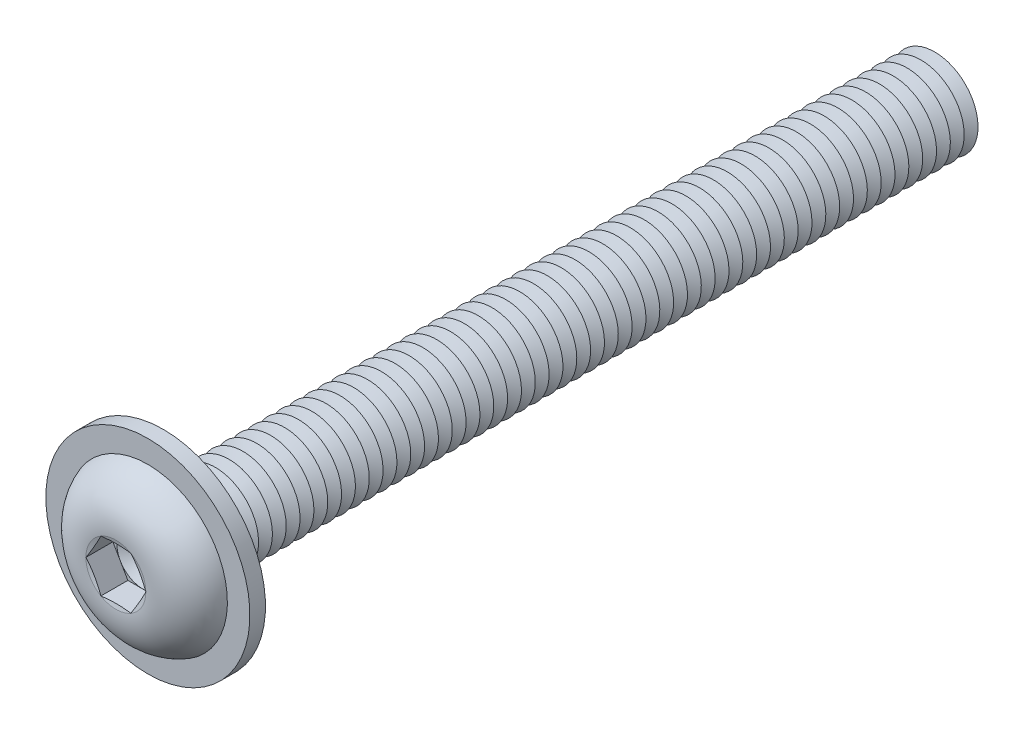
ISO-10303-21;
HEADER;
FILE_DESCRIPTION(('STEP AP214'),'2;1');
FILE_NAME('part.step','',(''),(''),'','','');
FILE_SCHEMA(('AUTOMOTIVE_DESIGN { 1 0 10303 214 1 1 1 1 }'));
ENDSEC;
DATA;
#1=APPLICATION_CONTEXT('core data for automotive mechanical design processes');
#2=APPLICATION_PROTOCOL_DEFINITION('international standard','automotive_design',2000,#1);
#3=PRODUCT_CONTEXT('',#1,'mechanical');
#4=PRODUCT('Part','Part','',(#3));
#5=PRODUCT_RELATED_PRODUCT_CATEGORY('part','',(#4));
#6=PRODUCT_DEFINITION_FORMATION('','',#4);
#7=PRODUCT_DEFINITION_CONTEXT('part definition',#1,'design');
#8=PRODUCT_DEFINITION('design','',#6,#7);
#9=PRODUCT_DEFINITION_SHAPE('','',#8);
#10=(LENGTH_UNIT() NAMED_UNIT(*) SI_UNIT(.MILLI.,.METRE.));
#11=(NAMED_UNIT(*) PLANE_ANGLE_UNIT() SI_UNIT($,.RADIAN.));
#12=(NAMED_UNIT(*) SI_UNIT($,.STERADIAN.) SOLID_ANGLE_UNIT());
#13=UNCERTAINTY_MEASURE_WITH_UNIT(LENGTH_MEASURE(1.E-05),#10,'distance_accuracy_value','');
#14=(GEOMETRIC_REPRESENTATION_CONTEXT(3) GLOBAL_UNCERTAINTY_ASSIGNED_CONTEXT((#13)) GLOBAL_UNIT_ASSIGNED_CONTEXT((#10,
#11,#12)) REPRESENTATION_CONTEXT('',''));
#15=CARTESIAN_POINT('',(0.,0.,0.));
#16=DIRECTION('',(0.,0.,1.));
#17=DIRECTION('',(1.,0.,0.));
#18=AXIS2_PLACEMENT_3D('',#15,#16,#17);
#19=CARTESIAN_POINT('',(0.,0.,-42.2));
#20=DIRECTION('',(0.,0.,1.));
#21=DIRECTION('',(0.,-1.,0.));
#22=AXIS2_PLACEMENT_3D('',#19,#20,#21);
#23=CONICAL_SURFACE('',#22,2.49999999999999,1.0471975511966);
#24=CARTESIAN_POINT('',(0.,0.,-42.6));
#25=DIRECTION('',(0.,0.,1.));
#26=DIRECTION('',(0.,-1.,0.));
#27=AXIS2_PLACEMENT_3D('',#24,#25,#26);
#28=CIRCLE('',#27,1.80717967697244);
#29=CARTESIAN_POINT('',(0.,-1.80717967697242,-42.6));
#30=VERTEX_POINT('',#29);
#31=EDGE_CURVE('E656',#30,#30,#28,.T.);
#32=ORIENTED_EDGE('',*,*,#31,.T.);
#33=EDGE_LOOP('',(#32));
#34=FACE_BOUND('',#33,.T.);
#35=CARTESIAN_POINT('',(0.,0.,-42.2));
#36=DIRECTION('',(0.,0.,1.));
#37=DIRECTION('',(0.,-1.,0.));
#38=AXIS2_PLACEMENT_3D('',#35,#36,#37);
#39=CIRCLE('',#38,2.49999999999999);
#40=CARTESIAN_POINT('',(0.,-2.49999999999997,-42.2));
#41=VERTEX_POINT('',#40);
#42=EDGE_CURVE('E652',#41,#41,#39,.T.);
#43=ORIENTED_EDGE('',*,*,#42,.F.);
#44=EDGE_LOOP('',(#43));
#45=FACE_BOUND('',#44,.T.);
#46=ADVANCED_FACE('F39',(#34,#45),#23,.T.);
#47=CARTESIAN_POINT('',(0.,0.,-42.6));
#48=DIRECTION('',(0.,0.,-1.));
#49=DIRECTION('',(0.,1.,0.));
#50=AXIS2_PLACEMENT_3D('',#47,#48,#49);
#51=CONICAL_SURFACE('',#50,1.80717967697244,1.04719755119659);
#52=CARTESIAN_POINT('',(0.,0.,-43.));
#53=DIRECTION('',(0.,0.,1.));
#54=DIRECTION('',(0.,-1.,0.));
#55=AXIS2_PLACEMENT_3D('',#52,#53,#54);
#56=CIRCLE('',#55,2.49999999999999);
#57=CARTESIAN_POINT('',(0.,-2.49999999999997,-43.));
#58=VERTEX_POINT('',#57);
#59=EDGE_CURVE('E660',#58,#58,#56,.T.);
#60=ORIENTED_EDGE('',*,*,#59,.T.);
#61=EDGE_LOOP('',(#60));
#62=FACE_BOUND('',#61,.T.);
#63=ORIENTED_EDGE('',*,*,#31,.F.);
#64=EDGE_LOOP('',(#63));
#65=FACE_BOUND('',#64,.T.);
#66=ADVANCED_FACE('F779',(#62,#65),#51,.T.);
#67=CARTESIAN_POINT('',(0.,2.5,-45.));
#68=DIRECTION('',(0.,0.,-1.));
#69=DIRECTION('',(0.,1.,0.));
#70=AXIS2_PLACEMENT_3D('',#67,#68,#69);
#71=PLANE('',#70);
#72=CARTESIAN_POINT('',(0.,0.,-45.));
#73=DIRECTION('',(0.,0.,1.));
#74=DIRECTION('',(0.,-1.,0.));
#75=AXIS2_PLACEMENT_3D('',#72,#73,#74);
#76=CIRCLE('',#75,1.80717967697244);
#77=CARTESIAN_POINT('',(0.,-1.80717967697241,-45.));
#78=VERTEX_POINT('',#77);
#79=EDGE_CURVE('E680',#78,#78,#76,.T.);
#80=ORIENTED_EDGE('',*,*,#79,.F.);
#81=EDGE_LOOP('',(#80));
#82=FACE_BOUND('',#81,.T.);
#83=ADVANCED_FACE('F785',(#82),#71,.T.);
#84=CARTESIAN_POINT('',(0.,0.,-44.6));
#85=DIRECTION('',(0.,0.,1.));
#86=DIRECTION('',(0.,-1.,0.));
#87=AXIS2_PLACEMENT_3D('',#84,#85,#86);
#88=CONICAL_SURFACE('',#87,2.49999999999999,1.0471975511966);
#89=ORIENTED_EDGE('',*,*,#79,.T.);
#90=EDGE_LOOP('',(#89));
#91=FACE_BOUND('',#90,.T.);
#92=CARTESIAN_POINT('',(0.,0.,-44.6));
#93=DIRECTION('',(0.,0.,1.));
#94=DIRECTION('',(0.,-1.,0.));
#95=AXIS2_PLACEMENT_3D('',#92,#93,#94);
#96=CIRCLE('',#95,2.49999999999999);
#97=CARTESIAN_POINT('',(0.,-2.49999999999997,-44.6));
#98=VERTEX_POINT('',#97);
#99=EDGE_CURVE('E676',#98,#98,#96,.T.);
#100=ORIENTED_EDGE('',*,*,#99,.F.);
#101=EDGE_LOOP('',(#100));
#102=FACE_BOUND('',#101,.T.);
#103=ADVANCED_FACE('F804',(#91,#102),#88,.T.);
#104=CARTESIAN_POINT('',(0.,0.,-44.2));
#105=DIRECTION('',(0.,0.,-1.));
#106=DIRECTION('',(0.,1.,0.));
#107=AXIS2_PLACEMENT_3D('',#104,#105,#106);
#108=CONICAL_SURFACE('',#107,1.80717967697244,1.04719755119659);
#109=ORIENTED_EDGE('',*,*,#99,.T.);
#110=EDGE_LOOP('',(#109));
#111=FACE_BOUND('',#110,.T.);
#112=CARTESIAN_POINT('',(0.,0.,-44.2));
#113=DIRECTION('',(0.,0.,1.));
#114=DIRECTION('',(0.,-1.,0.));
#115=AXIS2_PLACEMENT_3D('',#112,#113,#114);
#116=CIRCLE('',#115,1.80717967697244);
#117=CARTESIAN_POINT('',(0.,-1.80717967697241,-44.2));
#118=VERTEX_POINT('',#117);
#119=EDGE_CURVE('E672',#118,#118,#116,.T.);
#120=ORIENTED_EDGE('',*,*,#119,.F.);
#121=EDGE_LOOP('',(#120));
#122=FACE_BOUND('',#121,.T.);
#123=ADVANCED_FACE('F801',(#111,#122),#108,.T.);
#124=CARTESIAN_POINT('',(0.,0.,-43.8));
#125=DIRECTION('',(0.,0.,1.));
#126=DIRECTION('',(0.,-1.,0.));
#127=AXIS2_PLACEMENT_3D('',#124,#125,#126);
#128=CONICAL_SURFACE('',#127,2.49999999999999,1.0471975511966);
#129=ORIENTED_EDGE('',*,*,#119,.T.);
#130=EDGE_LOOP('',(#129));
#131=FACE_BOUND('',#130,.T.);
#132=CARTESIAN_POINT('',(0.,0.,-43.8));
#133=DIRECTION('',(0.,0.,1.));
#134=DIRECTION('',(0.,-1.,0.));
#135=AXIS2_PLACEMENT_3D('',#132,#133,#134);
#136=CIRCLE('',#135,2.49999999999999);
#137=CARTESIAN_POINT('',(0.,-2.49999999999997,-43.8));
#138=VERTEX_POINT('',#137);
#139=EDGE_CURVE('E668',#138,#138,#136,.T.);
#140=ORIENTED_EDGE('',*,*,#139,.F.);
#141=EDGE_LOOP('',(#140));
#142=FACE_BOUND('',#141,.T.);
#143=ADVANCED_FACE('F795',(#131,#142),#128,.T.);
#144=CARTESIAN_POINT('',(0.,0.,-43.4));
#145=DIRECTION('',(0.,0.,-1.));
#146=DIRECTION('',(0.,1.,0.));
#147=AXIS2_PLACEMENT_3D('',#144,#145,#146);
#148=CONICAL_SURFACE('',#147,1.80717967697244,1.04719755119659);
#149=ORIENTED_EDGE('',*,*,#139,.T.);
#150=EDGE_LOOP('',(#149));
#151=FACE_BOUND('',#150,.T.);
#152=CARTESIAN_POINT('',(0.,0.,-43.4));
#153=DIRECTION('',(0.,0.,1.));
#154=DIRECTION('',(0.,-1.,0.));
#155=AXIS2_PLACEMENT_3D('',#152,#153,#154);
#156=CIRCLE('',#155,1.80717967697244);
#157=CARTESIAN_POINT('',(0.,-1.80717967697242,-43.4));
#158=VERTEX_POINT('',#157);
#159=EDGE_CURVE('E664',#158,#158,#156,.T.);
#160=ORIENTED_EDGE('',*,*,#159,.F.);
#161=EDGE_LOOP('',(#160));
#162=FACE_BOUND('',#161,.T.);
#163=ADVANCED_FACE('F791',(#151,#162),#148,.T.);
#164=CARTESIAN_POINT('',(0.,0.,-43.));
#165=DIRECTION('',(0.,0.,1.));
#166=DIRECTION('',(0.,-1.,0.));
#167=AXIS2_PLACEMENT_3D('',#164,#165,#166);
#168=CONICAL_SURFACE('',#167,2.49999999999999,1.0471975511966);
#169=ORIENTED_EDGE('',*,*,#159,.T.);
#170=EDGE_LOOP('',(#169));
#171=FACE_BOUND('',#170,.T.);
#172=ORIENTED_EDGE('',*,*,#59,.F.);
#173=EDGE_LOOP('',(#172));
#174=FACE_BOUND('',#173,.T.);
#175=ADVANCED_FACE('F794',(#171,#174),#168,.T.);
#176=CARTESIAN_POINT('',(0.,0.,-41.4));
#177=DIRECTION('',(0.,0.,1.));
#178=DIRECTION('',(0.,-1.,0.));
#179=AXIS2_PLACEMENT_3D('',#176,#177,#178);
#180=CONICAL_SURFACE('',#179,2.49999999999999,1.0471975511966);
#181=CARTESIAN_POINT('',(0.,0.,-41.8));
#182=DIRECTION('',(0.,0.,1.));
#183=DIRECTION('',(0.,-1.,0.));
#184=AXIS2_PLACEMENT_3D('',#181,#182,#183);
#185=CIRCLE('',#184,1.80717967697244);
#186=CARTESIAN_POINT('',(0.,-1.80717967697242,-41.8));
#187=VERTEX_POINT('',#186);
#188=EDGE_CURVE('E648',#187,#187,#185,.T.);
#189=ORIENTED_EDGE('',*,*,#188,.T.);
#190=EDGE_LOOP('',(#189));
#191=FACE_BOUND('',#190,.T.);
#192=CARTESIAN_POINT('',(0.,0.,-41.4));
#193=DIRECTION('',(0.,0.,1.));
#194=DIRECTION('',(0.,-1.,0.));
#195=AXIS2_PLACEMENT_3D('',#192,#193,#194);
#196=CIRCLE('',#195,2.49999999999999);
#197=CARTESIAN_POINT('',(0.,-2.49999999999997,-41.4));
#198=VERTEX_POINT('',#197);
#199=EDGE_CURVE('E644',#198,#198,#196,.T.);
#200=ORIENTED_EDGE('',*,*,#199,.F.);
#201=EDGE_LOOP('',(#200));
#202=FACE_BOUND('',#201,.T.);
#203=ADVANCED_FACE('F799',(#191,#202),#180,.T.);
#204=CARTESIAN_POINT('',(0.,0.,-41.8));
#205=DIRECTION('',(0.,0.,-1.));
#206=DIRECTION('',(0.,1.,0.));
#207=AXIS2_PLACEMENT_3D('',#204,#205,#206);
#208=CONICAL_SURFACE('',#207,1.80717967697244,1.04719755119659);
#209=ORIENTED_EDGE('',*,*,#42,.T.);
#210=EDGE_LOOP('',(#209));
#211=FACE_BOUND('',#210,.T.);
#212=ORIENTED_EDGE('',*,*,#188,.F.);
#213=EDGE_LOOP('',(#212));
#214=FACE_BOUND('',#213,.T.);
#215=ADVANCED_FACE('F850',(#211,#214),#208,.T.);
#216=CARTESIAN_POINT('',(0.,0.,-40.6));
#217=DIRECTION('',(0.,0.,1.));
#218=DIRECTION('',(0.,-1.,0.));
#219=AXIS2_PLACEMENT_3D('',#216,#217,#218);
#220=CONICAL_SURFACE('',#219,2.49999999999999,1.0471975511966);
#221=CARTESIAN_POINT('',(0.,0.,-41.));
#222=DIRECTION('',(0.,0.,1.));
#223=DIRECTION('',(0.,-1.,0.));
#224=AXIS2_PLACEMENT_3D('',#221,#222,#223);
#225=CIRCLE('',#224,1.80717967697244);
#226=CARTESIAN_POINT('',(0.,-1.80717967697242,-41.));
#227=VERTEX_POINT('',#226);
#228=EDGE_CURVE('E640',#227,#227,#225,.T.);
#229=ORIENTED_EDGE('',*,*,#228,.T.);
#230=EDGE_LOOP('',(#229));
#231=FACE_BOUND('',#230,.T.);
#232=CARTESIAN_POINT('',(0.,0.,-40.6));
#233=DIRECTION('',(0.,0.,1.));
#234=DIRECTION('',(0.,-1.,0.));
#235=AXIS2_PLACEMENT_3D('',#232,#233,#234);
#236=CIRCLE('',#235,2.49999999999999);
#237=CARTESIAN_POINT('',(0.,-2.49999999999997,-40.6));
#238=VERTEX_POINT('',#237);
#239=EDGE_CURVE('E636',#238,#238,#236,.T.);
#240=ORIENTED_EDGE('',*,*,#239,.F.);
#241=EDGE_LOOP('',(#240));
#242=FACE_BOUND('',#241,.T.);
#243=ADVANCED_FACE('F856',(#231,#242),#220,.T.);
#244=CARTESIAN_POINT('',(0.,0.,-41.));
#245=DIRECTION('',(0.,0.,-1.));
#246=DIRECTION('',(0.,1.,0.));
#247=AXIS2_PLACEMENT_3D('',#244,#245,#246);
#248=CONICAL_SURFACE('',#247,1.80717967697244,1.04719755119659);
#249=ORIENTED_EDGE('',*,*,#199,.T.);
#250=EDGE_LOOP('',(#249));
#251=FACE_BOUND('',#250,.T.);
#252=ORIENTED_EDGE('',*,*,#228,.F.);
#253=EDGE_LOOP('',(#252));
#254=FACE_BOUND('',#253,.T.);
#255=ADVANCED_FACE('F863',(#251,#254),#248,.T.);
#256=CARTESIAN_POINT('',(0.,0.,-39.8));
#257=DIRECTION('',(0.,0.,1.));
#258=DIRECTION('',(0.,-1.,0.));
#259=AXIS2_PLACEMENT_3D('',#256,#257,#258);
#260=CONICAL_SURFACE('',#259,2.49999999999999,1.0471975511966);
#261=CARTESIAN_POINT('',(0.,0.,-40.2));
#262=DIRECTION('',(0.,0.,1.));
#263=DIRECTION('',(0.,-1.,0.));
#264=AXIS2_PLACEMENT_3D('',#261,#262,#263);
#265=CIRCLE('',#264,1.80717967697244);
#266=CARTESIAN_POINT('',(0.,-1.80717967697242,-40.2));
#267=VERTEX_POINT('',#266);
#268=EDGE_CURVE('E632',#267,#267,#265,.T.);
#269=ORIENTED_EDGE('',*,*,#268,.T.);
#270=EDGE_LOOP('',(#269));
#271=FACE_BOUND('',#270,.T.);
#272=CARTESIAN_POINT('',(0.,0.,-39.8));
#273=DIRECTION('',(0.,0.,1.));
#274=DIRECTION('',(0.,-1.,0.));
#275=AXIS2_PLACEMENT_3D('',#272,#273,#274);
#276=CIRCLE('',#275,2.49999999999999);
#277=CARTESIAN_POINT('',(0.,-2.49999999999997,-39.8));
#278=VERTEX_POINT('',#277);
#279=EDGE_CURVE('E628',#278,#278,#276,.T.);
#280=ORIENTED_EDGE('',*,*,#279,.F.);
#281=EDGE_LOOP('',(#280));
#282=FACE_BOUND('',#281,.T.);
#283=ADVANCED_FACE('F870',(#271,#282),#260,.T.);
#284=CARTESIAN_POINT('',(0.,0.,-40.2));
#285=DIRECTION('',(0.,0.,-1.));
#286=DIRECTION('',(0.,1.,0.));
#287=AXIS2_PLACEMENT_3D('',#284,#285,#286);
#288=CONICAL_SURFACE('',#287,1.80717967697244,1.04719755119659);
#289=ORIENTED_EDGE('',*,*,#239,.T.);
#290=EDGE_LOOP('',(#289));
#291=FACE_BOUND('',#290,.T.);
#292=ORIENTED_EDGE('',*,*,#268,.F.);
#293=EDGE_LOOP('',(#292));
#294=FACE_BOUND('',#293,.T.);
#295=ADVANCED_FACE('F877',(#291,#294),#288,.T.);
#296=CARTESIAN_POINT('',(0.,0.,-39.));
#297=DIRECTION('',(0.,0.,1.));
#298=DIRECTION('',(0.,-1.,0.));
#299=AXIS2_PLACEMENT_3D('',#296,#297,#298);
#300=CONICAL_SURFACE('',#299,2.49999999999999,1.0471975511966);
#301=CARTESIAN_POINT('',(0.,0.,-39.4));
#302=DIRECTION('',(0.,0.,1.));
#303=DIRECTION('',(0.,-1.,0.));
#304=AXIS2_PLACEMENT_3D('',#301,#302,#303);
#305=CIRCLE('',#304,1.80717967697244);
#306=CARTESIAN_POINT('',(0.,-1.80717967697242,-39.4));
#307=VERTEX_POINT('',#306);
#308=EDGE_CURVE('E624',#307,#307,#305,.T.);
#309=ORIENTED_EDGE('',*,*,#308,.T.);
#310=EDGE_LOOP('',(#309));
#311=FACE_BOUND('',#310,.T.);
#312=CARTESIAN_POINT('',(0.,0.,-39.));
#313=DIRECTION('',(0.,0.,1.));
#314=DIRECTION('',(0.,-1.,0.));
#315=AXIS2_PLACEMENT_3D('',#312,#313,#314);
#316=CIRCLE('',#315,2.49999999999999);
#317=CARTESIAN_POINT('',(0.,-2.49999999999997,-39.));
#318=VERTEX_POINT('',#317);
#319=EDGE_CURVE('E620',#318,#318,#316,.T.);
#320=ORIENTED_EDGE('',*,*,#319,.F.);
#321=EDGE_LOOP('',(#320));
#322=FACE_BOUND('',#321,.T.);
#323=ADVANCED_FACE('F884',(#311,#322),#300,.T.);
#324=CARTESIAN_POINT('',(0.,0.,-39.4));
#325=DIRECTION('',(0.,0.,-1.));
#326=DIRECTION('',(0.,1.,0.));
#327=AXIS2_PLACEMENT_3D('',#324,#325,#326);
#328=CONICAL_SURFACE('',#327,1.80717967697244,1.04719755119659);
#329=ORIENTED_EDGE('',*,*,#279,.T.);
#330=EDGE_LOOP('',(#329));
#331=FACE_BOUND('',#330,.T.);
#332=ORIENTED_EDGE('',*,*,#308,.F.);
#333=EDGE_LOOP('',(#332));
#334=FACE_BOUND('',#333,.T.);
#335=ADVANCED_FACE('F891',(#331,#334),#328,.T.);
#336=CARTESIAN_POINT('',(0.,0.,-38.2));
#337=DIRECTION('',(0.,0.,1.));
#338=DIRECTION('',(0.,-1.,0.));
#339=AXIS2_PLACEMENT_3D('',#336,#337,#338);
#340=CONICAL_SURFACE('',#339,2.49999999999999,1.0471975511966);
#341=CARTESIAN_POINT('',(0.,0.,-38.6));
#342=DIRECTION('',(0.,0.,1.));
#343=DIRECTION('',(0.,-1.,0.));
#344=AXIS2_PLACEMENT_3D('',#341,#342,#343);
#345=CIRCLE('',#344,1.80717967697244);
#346=CARTESIAN_POINT('',(0.,-1.80717967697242,-38.6));
#347=VERTEX_POINT('',#346);
#348=EDGE_CURVE('E616',#347,#347,#345,.T.);
#349=ORIENTED_EDGE('',*,*,#348,.T.);
#350=EDGE_LOOP('',(#349));
#351=FACE_BOUND('',#350,.T.);
#352=CARTESIAN_POINT('',(0.,0.,-38.2));
#353=DIRECTION('',(0.,0.,1.));
#354=DIRECTION('',(0.,-1.,0.));
#355=AXIS2_PLACEMENT_3D('',#352,#353,#354);
#356=CIRCLE('',#355,2.49999999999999);
#357=CARTESIAN_POINT('',(0.,-2.49999999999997,-38.2));
#358=VERTEX_POINT('',#357);
#359=EDGE_CURVE('E612',#358,#358,#356,.T.);
#360=ORIENTED_EDGE('',*,*,#359,.F.);
#361=EDGE_LOOP('',(#360));
#362=FACE_BOUND('',#361,.T.);
#363=ADVANCED_FACE('F898',(#351,#362),#340,.T.);
#364=CARTESIAN_POINT('',(0.,0.,-38.6));
#365=DIRECTION('',(0.,0.,-1.));
#366=DIRECTION('',(0.,1.,0.));
#367=AXIS2_PLACEMENT_3D('',#364,#365,#366);
#368=CONICAL_SURFACE('',#367,1.80717967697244,1.04719755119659);
#369=ORIENTED_EDGE('',*,*,#319,.T.);
#370=EDGE_LOOP('',(#369));
#371=FACE_BOUND('',#370,.T.);
#372=ORIENTED_EDGE('',*,*,#348,.F.);
#373=EDGE_LOOP('',(#372));
#374=FACE_BOUND('',#373,.T.);
#375=ADVANCED_FACE('F905',(#371,#374),#368,.T.);
#376=CARTESIAN_POINT('',(0.,0.,-37.4));
#377=DIRECTION('',(0.,0.,1.));
#378=DIRECTION('',(0.,-1.,0.));
#379=AXIS2_PLACEMENT_3D('',#376,#377,#378);
#380=CONICAL_SURFACE('',#379,2.49999999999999,1.0471975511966);
#381=CARTESIAN_POINT('',(0.,0.,-37.8));
#382=DIRECTION('',(0.,0.,1.));
#383=DIRECTION('',(0.,-1.,0.));
#384=AXIS2_PLACEMENT_3D('',#381,#382,#383);
#385=CIRCLE('',#384,1.80717967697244);
#386=CARTESIAN_POINT('',(0.,-1.80717967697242,-37.8));
#387=VERTEX_POINT('',#386);
#388=EDGE_CURVE('E608',#387,#387,#385,.T.);
#389=ORIENTED_EDGE('',*,*,#388,.T.);
#390=EDGE_LOOP('',(#389));
#391=FACE_BOUND('',#390,.T.);
#392=CARTESIAN_POINT('',(0.,0.,-37.4));
#393=DIRECTION('',(0.,0.,1.));
#394=DIRECTION('',(0.,-1.,0.));
#395=AXIS2_PLACEMENT_3D('',#392,#393,#394);
#396=CIRCLE('',#395,2.49999999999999);
#397=CARTESIAN_POINT('',(0.,-2.49999999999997,-37.4));
#398=VERTEX_POINT('',#397);
#399=EDGE_CURVE('E604',#398,#398,#396,.T.);
#400=ORIENTED_EDGE('',*,*,#399,.F.);
#401=EDGE_LOOP('',(#400));
#402=FACE_BOUND('',#401,.T.);
#403=ADVANCED_FACE('F912',(#391,#402),#380,.T.);
#404=CARTESIAN_POINT('',(0.,0.,-37.8));
#405=DIRECTION('',(0.,0.,-1.));
#406=DIRECTION('',(0.,1.,0.));
#407=AXIS2_PLACEMENT_3D('',#404,#405,#406);
#408=CONICAL_SURFACE('',#407,1.80717967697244,1.04719755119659);
#409=ORIENTED_EDGE('',*,*,#359,.T.);
#410=EDGE_LOOP('',(#409));
#411=FACE_BOUND('',#410,.T.);
#412=ORIENTED_EDGE('',*,*,#388,.F.);
#413=EDGE_LOOP('',(#412));
#414=FACE_BOUND('',#413,.T.);
#415=ADVANCED_FACE('F919',(#411,#414),#408,.T.);
#416=CARTESIAN_POINT('',(0.,0.,-36.6));
#417=DIRECTION('',(0.,0.,1.));
#418=DIRECTION('',(0.,-1.,0.));
#419=AXIS2_PLACEMENT_3D('',#416,#417,#418);
#420=CONICAL_SURFACE('',#419,2.49999999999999,1.0471975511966);
#421=CARTESIAN_POINT('',(0.,0.,-37.));
#422=DIRECTION('',(0.,0.,1.));
#423=DIRECTION('',(0.,-1.,0.));
#424=AXIS2_PLACEMENT_3D('',#421,#422,#423);
#425=CIRCLE('',#424,1.80717967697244);
#426=CARTESIAN_POINT('',(0.,-1.80717967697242,-37.));
#427=VERTEX_POINT('',#426);
#428=EDGE_CURVE('E600',#427,#427,#425,.T.);
#429=ORIENTED_EDGE('',*,*,#428,.T.);
#430=EDGE_LOOP('',(#429));
#431=FACE_BOUND('',#430,.T.);
#432=CARTESIAN_POINT('',(0.,0.,-36.6));
#433=DIRECTION('',(0.,0.,1.));
#434=DIRECTION('',(0.,-1.,0.));
#435=AXIS2_PLACEMENT_3D('',#432,#433,#434);
#436=CIRCLE('',#435,2.49999999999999);
#437=CARTESIAN_POINT('',(0.,-2.49999999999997,-36.6));
#438=VERTEX_POINT('',#437);
#439=EDGE_CURVE('E596',#438,#438,#436,.T.);
#440=ORIENTED_EDGE('',*,*,#439,.F.);
#441=EDGE_LOOP('',(#440));
#442=FACE_BOUND('',#441,.T.);
#443=ADVANCED_FACE('F926',(#431,#442),#420,.T.);
#444=CARTESIAN_POINT('',(0.,0.,-37.));
#445=DIRECTION('',(0.,0.,-1.));
#446=DIRECTION('',(0.,1.,0.));
#447=AXIS2_PLACEMENT_3D('',#444,#445,#446);
#448=CONICAL_SURFACE('',#447,1.80717967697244,1.04719755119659);
#449=ORIENTED_EDGE('',*,*,#399,.T.);
#450=EDGE_LOOP('',(#449));
#451=FACE_BOUND('',#450,.T.);
#452=ORIENTED_EDGE('',*,*,#428,.F.);
#453=EDGE_LOOP('',(#452));
#454=FACE_BOUND('',#453,.T.);
#455=ADVANCED_FACE('F933',(#451,#454),#448,.T.);
#456=CARTESIAN_POINT('',(0.,0.,-35.8));
#457=DIRECTION('',(0.,0.,1.));
#458=DIRECTION('',(0.,-1.,0.));
#459=AXIS2_PLACEMENT_3D('',#456,#457,#458);
#460=CONICAL_SURFACE('',#459,2.49999999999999,1.0471975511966);
#461=CARTESIAN_POINT('',(0.,0.,-36.2));
#462=DIRECTION('',(0.,0.,1.));
#463=DIRECTION('',(0.,-1.,0.));
#464=AXIS2_PLACEMENT_3D('',#461,#462,#463);
#465=CIRCLE('',#464,1.80717967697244);
#466=CARTESIAN_POINT('',(0.,-1.80717967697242,-36.2));
#467=VERTEX_POINT('',#466);
#468=EDGE_CURVE('E592',#467,#467,#465,.T.);
#469=ORIENTED_EDGE('',*,*,#468,.T.);
#470=EDGE_LOOP('',(#469));
#471=FACE_BOUND('',#470,.T.);
#472=CARTESIAN_POINT('',(0.,0.,-35.8));
#473=DIRECTION('',(0.,0.,1.));
#474=DIRECTION('',(0.,-1.,0.));
#475=AXIS2_PLACEMENT_3D('',#472,#473,#474);
#476=CIRCLE('',#475,2.49999999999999);
#477=CARTESIAN_POINT('',(0.,-2.49999999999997,-35.8));
#478=VERTEX_POINT('',#477);
#479=EDGE_CURVE('E588',#478,#478,#476,.T.);
#480=ORIENTED_EDGE('',*,*,#479,.F.);
#481=EDGE_LOOP('',(#480));
#482=FACE_BOUND('',#481,.T.);
#483=ADVANCED_FACE('F940',(#471,#482),#460,.T.);
#484=CARTESIAN_POINT('',(0.,0.,-36.2));
#485=DIRECTION('',(0.,0.,-1.));
#486=DIRECTION('',(0.,1.,0.));
#487=AXIS2_PLACEMENT_3D('',#484,#485,#486);
#488=CONICAL_SURFACE('',#487,1.80717967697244,1.04719755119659);
#489=ORIENTED_EDGE('',*,*,#439,.T.);
#490=EDGE_LOOP('',(#489));
#491=FACE_BOUND('',#490,.T.);
#492=ORIENTED_EDGE('',*,*,#468,.F.);
#493=EDGE_LOOP('',(#492));
#494=FACE_BOUND('',#493,.T.);
#495=ADVANCED_FACE('F947',(#491,#494),#488,.T.);
#496=CARTESIAN_POINT('',(0.,0.,-35.));
#497=DIRECTION('',(0.,0.,1.));
#498=DIRECTION('',(0.,-1.,0.));
#499=AXIS2_PLACEMENT_3D('',#496,#497,#498);
#500=CONICAL_SURFACE('',#499,2.49999999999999,1.0471975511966);
#501=CARTESIAN_POINT('',(0.,0.,-35.4));
#502=DIRECTION('',(0.,0.,1.));
#503=DIRECTION('',(0.,-1.,0.));
#504=AXIS2_PLACEMENT_3D('',#501,#502,#503);
#505=CIRCLE('',#504,1.80717967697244);
#506=CARTESIAN_POINT('',(0.,-1.80717967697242,-35.4));
#507=VERTEX_POINT('',#506);
#508=EDGE_CURVE('E584',#507,#507,#505,.T.);
#509=ORIENTED_EDGE('',*,*,#508,.T.);
#510=EDGE_LOOP('',(#509));
#511=FACE_BOUND('',#510,.T.);
#512=CARTESIAN_POINT('',(0.,0.,-35.));
#513=DIRECTION('',(0.,0.,1.));
#514=DIRECTION('',(0.,-1.,0.));
#515=AXIS2_PLACEMENT_3D('',#512,#513,#514);
#516=CIRCLE('',#515,2.49999999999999);
#517=CARTESIAN_POINT('',(0.,-2.49999999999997,-35.));
#518=VERTEX_POINT('',#517);
#519=EDGE_CURVE('E580',#518,#518,#516,.T.);
#520=ORIENTED_EDGE('',*,*,#519,.F.);
#521=EDGE_LOOP('',(#520));
#522=FACE_BOUND('',#521,.T.);
#523=ADVANCED_FACE('F954',(#511,#522),#500,.T.);
#524=CARTESIAN_POINT('',(0.,0.,-35.4));
#525=DIRECTION('',(0.,0.,-1.));
#526=DIRECTION('',(0.,1.,0.));
#527=AXIS2_PLACEMENT_3D('',#524,#525,#526);
#528=CONICAL_SURFACE('',#527,1.80717967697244,1.04719755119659);
#529=ORIENTED_EDGE('',*,*,#479,.T.);
#530=EDGE_LOOP('',(#529));
#531=FACE_BOUND('',#530,.T.);
#532=ORIENTED_EDGE('',*,*,#508,.F.);
#533=EDGE_LOOP('',(#532));
#534=FACE_BOUND('',#533,.T.);
#535=ADVANCED_FACE('F961',(#531,#534),#528,.T.);
#536=CARTESIAN_POINT('',(0.,0.,-34.2));
#537=DIRECTION('',(0.,0.,1.));
#538=DIRECTION('',(0.,-1.,0.));
#539=AXIS2_PLACEMENT_3D('',#536,#537,#538);
#540=CONICAL_SURFACE('',#539,2.49999999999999,1.0471975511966);
#541=CARTESIAN_POINT('',(0.,0.,-34.6));
#542=DIRECTION('',(0.,0.,1.));
#543=DIRECTION('',(0.,-1.,0.));
#544=AXIS2_PLACEMENT_3D('',#541,#542,#543);
#545=CIRCLE('',#544,1.80717967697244);
#546=CARTESIAN_POINT('',(0.,-1.80717967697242,-34.6));
#547=VERTEX_POINT('',#546);
#548=EDGE_CURVE('E576',#547,#547,#545,.T.);
#549=ORIENTED_EDGE('',*,*,#548,.T.);
#550=EDGE_LOOP('',(#549));
#551=FACE_BOUND('',#550,.T.);
#552=CARTESIAN_POINT('',(0.,0.,-34.2));
#553=DIRECTION('',(0.,0.,1.));
#554=DIRECTION('',(0.,-1.,0.));
#555=AXIS2_PLACEMENT_3D('',#552,#553,#554);
#556=CIRCLE('',#555,2.49999999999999);
#557=CARTESIAN_POINT('',(0.,-2.49999999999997,-34.2));
#558=VERTEX_POINT('',#557);
#559=EDGE_CURVE('E572',#558,#558,#556,.T.);
#560=ORIENTED_EDGE('',*,*,#559,.F.);
#561=EDGE_LOOP('',(#560));
#562=FACE_BOUND('',#561,.T.);
#563=ADVANCED_FACE('F968',(#551,#562),#540,.T.);
#564=CARTESIAN_POINT('',(0.,0.,-34.6));
#565=DIRECTION('',(0.,0.,-1.));
#566=DIRECTION('',(0.,1.,0.));
#567=AXIS2_PLACEMENT_3D('',#564,#565,#566);
#568=CONICAL_SURFACE('',#567,1.80717967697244,1.04719755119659);
#569=ORIENTED_EDGE('',*,*,#519,.T.);
#570=EDGE_LOOP('',(#569));
#571=FACE_BOUND('',#570,.T.);
#572=ORIENTED_EDGE('',*,*,#548,.F.);
#573=EDGE_LOOP('',(#572));
#574=FACE_BOUND('',#573,.T.);
#575=ADVANCED_FACE('F975',(#571,#574),#568,.T.);
#576=CARTESIAN_POINT('',(0.,0.,-33.4));
#577=DIRECTION('',(0.,0.,1.));
#578=DIRECTION('',(0.,-1.,0.));
#579=AXIS2_PLACEMENT_3D('',#576,#577,#578);
#580=CONICAL_SURFACE('',#579,2.49999999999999,1.0471975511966);
#581=CARTESIAN_POINT('',(0.,0.,-33.8));
#582=DIRECTION('',(0.,0.,1.));
#583=DIRECTION('',(0.,-1.,0.));
#584=AXIS2_PLACEMENT_3D('',#581,#582,#583);
#585=CIRCLE('',#584,1.80717967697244);
#586=CARTESIAN_POINT('',(0.,-1.80717967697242,-33.8));
#587=VERTEX_POINT('',#586);
#588=EDGE_CURVE('E568',#587,#587,#585,.T.);
#589=ORIENTED_EDGE('',*,*,#588,.T.);
#590=EDGE_LOOP('',(#589));
#591=FACE_BOUND('',#590,.T.);
#592=CARTESIAN_POINT('',(0.,0.,-33.4));
#593=DIRECTION('',(0.,0.,1.));
#594=DIRECTION('',(0.,-1.,0.));
#595=AXIS2_PLACEMENT_3D('',#592,#593,#594);
#596=CIRCLE('',#595,2.49999999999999);
#597=CARTESIAN_POINT('',(0.,-2.49999999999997,-33.4));
#598=VERTEX_POINT('',#597);
#599=EDGE_CURVE('E564',#598,#598,#596,.T.);
#600=ORIENTED_EDGE('',*,*,#599,.F.);
#601=EDGE_LOOP('',(#600));
#602=FACE_BOUND('',#601,.T.);
#603=ADVANCED_FACE('F982',(#591,#602),#580,.T.);
#604=CARTESIAN_POINT('',(0.,0.,-33.8));
#605=DIRECTION('',(0.,0.,-1.));
#606=DIRECTION('',(0.,1.,0.));
#607=AXIS2_PLACEMENT_3D('',#604,#605,#606);
#608=CONICAL_SURFACE('',#607,1.80717967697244,1.04719755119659);
#609=ORIENTED_EDGE('',*,*,#559,.T.);
#610=EDGE_LOOP('',(#609));
#611=FACE_BOUND('',#610,.T.);
#612=ORIENTED_EDGE('',*,*,#588,.F.);
#613=EDGE_LOOP('',(#612));
#614=FACE_BOUND('',#613,.T.);
#615=ADVANCED_FACE('F989',(#611,#614),#608,.T.);
#616=CARTESIAN_POINT('',(0.,0.,-32.6));
#617=DIRECTION('',(0.,0.,1.));
#618=DIRECTION('',(0.,-1.,0.));
#619=AXIS2_PLACEMENT_3D('',#616,#617,#618);
#620=CONICAL_SURFACE('',#619,2.49999999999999,1.0471975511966);
#621=CARTESIAN_POINT('',(0.,0.,-33.));
#622=DIRECTION('',(0.,0.,1.));
#623=DIRECTION('',(0.,-1.,0.));
#624=AXIS2_PLACEMENT_3D('',#621,#622,#623);
#625=CIRCLE('',#624,1.80717967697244);
#626=CARTESIAN_POINT('',(0.,-1.80717967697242,-33.));
#627=VERTEX_POINT('',#626);
#628=EDGE_CURVE('E560',#627,#627,#625,.T.);
#629=ORIENTED_EDGE('',*,*,#628,.T.);
#630=EDGE_LOOP('',(#629));
#631=FACE_BOUND('',#630,.T.);
#632=CARTESIAN_POINT('',(0.,0.,-32.6));
#633=DIRECTION('',(0.,0.,1.));
#634=DIRECTION('',(0.,-1.,0.));
#635=AXIS2_PLACEMENT_3D('',#632,#633,#634);
#636=CIRCLE('',#635,2.49999999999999);
#637=CARTESIAN_POINT('',(0.,-2.49999999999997,-32.6));
#638=VERTEX_POINT('',#637);
#639=EDGE_CURVE('E556',#638,#638,#636,.T.);
#640=ORIENTED_EDGE('',*,*,#639,.F.);
#641=EDGE_LOOP('',(#640));
#642=FACE_BOUND('',#641,.T.);
#643=ADVANCED_FACE('F996',(#631,#642),#620,.T.);
#644=CARTESIAN_POINT('',(0.,0.,-33.));
#645=DIRECTION('',(0.,0.,-1.));
#646=DIRECTION('',(0.,1.,0.));
#647=AXIS2_PLACEMENT_3D('',#644,#645,#646);
#648=CONICAL_SURFACE('',#647,1.80717967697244,1.04719755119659);
#649=ORIENTED_EDGE('',*,*,#599,.T.);
#650=EDGE_LOOP('',(#649));
#651=FACE_BOUND('',#650,.T.);
#652=ORIENTED_EDGE('',*,*,#628,.F.);
#653=EDGE_LOOP('',(#652));
#654=FACE_BOUND('',#653,.T.);
#655=ADVANCED_FACE('F1003',(#651,#654),#648,.T.);
#656=CARTESIAN_POINT('',(0.,0.,-31.8));
#657=DIRECTION('',(0.,0.,1.));
#658=DIRECTION('',(0.,-1.,0.));
#659=AXIS2_PLACEMENT_3D('',#656,#657,#658);
#660=CONICAL_SURFACE('',#659,2.49999999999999,1.0471975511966);
#661=CARTESIAN_POINT('',(0.,0.,-32.2));
#662=DIRECTION('',(0.,0.,1.));
#663=DIRECTION('',(0.,-1.,0.));
#664=AXIS2_PLACEMENT_3D('',#661,#662,#663);
#665=CIRCLE('',#664,1.80717967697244);
#666=CARTESIAN_POINT('',(0.,-1.80717967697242,-32.2));
#667=VERTEX_POINT('',#666);
#668=EDGE_CURVE('E552',#667,#667,#665,.T.);
#669=ORIENTED_EDGE('',*,*,#668,.T.);
#670=EDGE_LOOP('',(#669));
#671=FACE_BOUND('',#670,.T.);
#672=CARTESIAN_POINT('',(0.,0.,-31.8));
#673=DIRECTION('',(0.,0.,1.));
#674=DIRECTION('',(0.,-1.,0.));
#675=AXIS2_PLACEMENT_3D('',#672,#673,#674);
#676=CIRCLE('',#675,2.49999999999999);
#677=CARTESIAN_POINT('',(0.,-2.49999999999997,-31.8));
#678=VERTEX_POINT('',#677);
#679=EDGE_CURVE('E548',#678,#678,#676,.T.);
#680=ORIENTED_EDGE('',*,*,#679,.F.);
#681=EDGE_LOOP('',(#680));
#682=FACE_BOUND('',#681,.T.);
#683=ADVANCED_FACE('F1010',(#671,#682),#660,.T.);
#684=CARTESIAN_POINT('',(0.,0.,-32.2));
#685=DIRECTION('',(0.,0.,-1.));
#686=DIRECTION('',(0.,1.,0.));
#687=AXIS2_PLACEMENT_3D('',#684,#685,#686);
#688=CONICAL_SURFACE('',#687,1.80717967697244,1.04719755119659);
#689=ORIENTED_EDGE('',*,*,#639,.T.);
#690=EDGE_LOOP('',(#689));
#691=FACE_BOUND('',#690,.T.);
#692=ORIENTED_EDGE('',*,*,#668,.F.);
#693=EDGE_LOOP('',(#692));
#694=FACE_BOUND('',#693,.T.);
#695=ADVANCED_FACE('F1017',(#691,#694),#688,.T.);
#696=CARTESIAN_POINT('',(0.,0.,-31.));
#697=DIRECTION('',(0.,0.,1.));
#698=DIRECTION('',(0.,-1.,0.));
#699=AXIS2_PLACEMENT_3D('',#696,#697,#698);
#700=CONICAL_SURFACE('',#699,2.49999999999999,1.0471975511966);
#701=CARTESIAN_POINT('',(0.,0.,-31.4));
#702=DIRECTION('',(0.,0.,1.));
#703=DIRECTION('',(0.,-1.,0.));
#704=AXIS2_PLACEMENT_3D('',#701,#702,#703);
#705=CIRCLE('',#704,1.80717967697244);
#706=CARTESIAN_POINT('',(0.,-1.80717967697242,-31.4));
#707=VERTEX_POINT('',#706);
#708=EDGE_CURVE('E544',#707,#707,#705,.T.);
#709=ORIENTED_EDGE('',*,*,#708,.T.);
#710=EDGE_LOOP('',(#709));
#711=FACE_BOUND('',#710,.T.);
#712=CARTESIAN_POINT('',(0.,0.,-31.));
#713=DIRECTION('',(0.,0.,1.));
#714=DIRECTION('',(0.,-1.,0.));
#715=AXIS2_PLACEMENT_3D('',#712,#713,#714);
#716=CIRCLE('',#715,2.49999999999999);
#717=CARTESIAN_POINT('',(0.,-2.49999999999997,-31.));
#718=VERTEX_POINT('',#717);
#719=EDGE_CURVE('E540',#718,#718,#716,.T.);
#720=ORIENTED_EDGE('',*,*,#719,.F.);
#721=EDGE_LOOP('',(#720));
#722=FACE_BOUND('',#721,.T.);
#723=ADVANCED_FACE('F1024',(#711,#722),#700,.T.);
#724=CARTESIAN_POINT('',(0.,0.,-31.4));
#725=DIRECTION('',(0.,0.,-1.));
#726=DIRECTION('',(0.,1.,0.));
#727=AXIS2_PLACEMENT_3D('',#724,#725,#726);
#728=CONICAL_SURFACE('',#727,1.80717967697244,1.04719755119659);
#729=ORIENTED_EDGE('',*,*,#679,.T.);
#730=EDGE_LOOP('',(#729));
#731=FACE_BOUND('',#730,.T.);
#732=ORIENTED_EDGE('',*,*,#708,.F.);
#733=EDGE_LOOP('',(#732));
#734=FACE_BOUND('',#733,.T.);
#735=ADVANCED_FACE('F1031',(#731,#734),#728,.T.);
#736=CARTESIAN_POINT('',(0.,0.,-30.2));
#737=DIRECTION('',(0.,0.,1.));
#738=DIRECTION('',(0.,-1.,0.));
#739=AXIS2_PLACEMENT_3D('',#736,#737,#738);
#740=CONICAL_SURFACE('',#739,2.49999999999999,1.0471975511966);
#741=CARTESIAN_POINT('',(0.,0.,-30.6));
#742=DIRECTION('',(0.,0.,1.));
#743=DIRECTION('',(0.,-1.,0.));
#744=AXIS2_PLACEMENT_3D('',#741,#742,#743);
#745=CIRCLE('',#744,1.80717967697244);
#746=CARTESIAN_POINT('',(0.,-1.80717967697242,-30.6));
#747=VERTEX_POINT('',#746);
#748=EDGE_CURVE('E536',#747,#747,#745,.T.);
#749=ORIENTED_EDGE('',*,*,#748,.T.);
#750=EDGE_LOOP('',(#749));
#751=FACE_BOUND('',#750,.T.);
#752=CARTESIAN_POINT('',(0.,0.,-30.2));
#753=DIRECTION('',(0.,0.,1.));
#754=DIRECTION('',(0.,-1.,0.));
#755=AXIS2_PLACEMENT_3D('',#752,#753,#754);
#756=CIRCLE('',#755,2.49999999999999);
#757=CARTESIAN_POINT('',(0.,-2.49999999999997,-30.2));
#758=VERTEX_POINT('',#757);
#759=EDGE_CURVE('E532',#758,#758,#756,.T.);
#760=ORIENTED_EDGE('',*,*,#759,.F.);
#761=EDGE_LOOP('',(#760));
#762=FACE_BOUND('',#761,.T.);
#763=ADVANCED_FACE('F1038',(#751,#762),#740,.T.);
#764=CARTESIAN_POINT('',(0.,0.,-30.6));
#765=DIRECTION('',(0.,0.,-1.));
#766=DIRECTION('',(0.,1.,0.));
#767=AXIS2_PLACEMENT_3D('',#764,#765,#766);
#768=CONICAL_SURFACE('',#767,1.80717967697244,1.04719755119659);
#769=ORIENTED_EDGE('',*,*,#719,.T.);
#770=EDGE_LOOP('',(#769));
#771=FACE_BOUND('',#770,.T.);
#772=ORIENTED_EDGE('',*,*,#748,.F.);
#773=EDGE_LOOP('',(#772));
#774=FACE_BOUND('',#773,.T.);
#775=ADVANCED_FACE('F1045',(#771,#774),#768,.T.);
#776=CARTESIAN_POINT('',(0.,0.,-29.4));
#777=DIRECTION('',(0.,0.,1.));
#778=DIRECTION('',(0.,-1.,0.));
#779=AXIS2_PLACEMENT_3D('',#776,#777,#778);
#780=CONICAL_SURFACE('',#779,2.49999999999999,1.0471975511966);
#781=CARTESIAN_POINT('',(0.,0.,-29.8));
#782=DIRECTION('',(0.,0.,1.));
#783=DIRECTION('',(0.,-1.,0.));
#784=AXIS2_PLACEMENT_3D('',#781,#782,#783);
#785=CIRCLE('',#784,1.80717967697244);
#786=CARTESIAN_POINT('',(0.,-1.80717967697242,-29.8));
#787=VERTEX_POINT('',#786);
#788=EDGE_CURVE('E528',#787,#787,#785,.T.);
#789=ORIENTED_EDGE('',*,*,#788,.T.);
#790=EDGE_LOOP('',(#789));
#791=FACE_BOUND('',#790,.T.);
#792=CARTESIAN_POINT('',(0.,0.,-29.4));
#793=DIRECTION('',(0.,0.,1.));
#794=DIRECTION('',(0.,-1.,0.));
#795=AXIS2_PLACEMENT_3D('',#792,#793,#794);
#796=CIRCLE('',#795,2.49999999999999);
#797=CARTESIAN_POINT('',(0.,-2.49999999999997,-29.4));
#798=VERTEX_POINT('',#797);
#799=EDGE_CURVE('E524',#798,#798,#796,.T.);
#800=ORIENTED_EDGE('',*,*,#799,.F.);
#801=EDGE_LOOP('',(#800));
#802=FACE_BOUND('',#801,.T.);
#803=ADVANCED_FACE('F1052',(#791,#802),#780,.T.);
#804=CARTESIAN_POINT('',(0.,0.,-29.8));
#805=DIRECTION('',(0.,0.,-1.));
#806=DIRECTION('',(0.,1.,0.));
#807=AXIS2_PLACEMENT_3D('',#804,#805,#806);
#808=CONICAL_SURFACE('',#807,1.80717967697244,1.04719755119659);
#809=ORIENTED_EDGE('',*,*,#759,.T.);
#810=EDGE_LOOP('',(#809));
#811=FACE_BOUND('',#810,.T.);
#812=ORIENTED_EDGE('',*,*,#788,.F.);
#813=EDGE_LOOP('',(#812));
#814=FACE_BOUND('',#813,.T.);
#815=ADVANCED_FACE('F1059',(#811,#814),#808,.T.);
#816=CARTESIAN_POINT('',(0.,0.,-28.6));
#817=DIRECTION('',(0.,0.,1.));
#818=DIRECTION('',(0.,-1.,0.));
#819=AXIS2_PLACEMENT_3D('',#816,#817,#818);
#820=CONICAL_SURFACE('',#819,2.49999999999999,1.0471975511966);
#821=CARTESIAN_POINT('',(0.,0.,-29.));
#822=DIRECTION('',(0.,0.,1.));
#823=DIRECTION('',(0.,-1.,0.));
#824=AXIS2_PLACEMENT_3D('',#821,#822,#823);
#825=CIRCLE('',#824,1.80717967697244);
#826=CARTESIAN_POINT('',(0.,-1.80717967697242,-29.));
#827=VERTEX_POINT('',#826);
#828=EDGE_CURVE('E520',#827,#827,#825,.T.);
#829=ORIENTED_EDGE('',*,*,#828,.T.);
#830=EDGE_LOOP('',(#829));
#831=FACE_BOUND('',#830,.T.);
#832=CARTESIAN_POINT('',(0.,0.,-28.6));
#833=DIRECTION('',(0.,0.,1.));
#834=DIRECTION('',(0.,-1.,0.));
#835=AXIS2_PLACEMENT_3D('',#832,#833,#834);
#836=CIRCLE('',#835,2.49999999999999);
#837=CARTESIAN_POINT('',(0.,-2.49999999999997,-28.6));
#838=VERTEX_POINT('',#837);
#839=EDGE_CURVE('E516',#838,#838,#836,.T.);
#840=ORIENTED_EDGE('',*,*,#839,.F.);
#841=EDGE_LOOP('',(#840));
#842=FACE_BOUND('',#841,.T.);
#843=ADVANCED_FACE('F1066',(#831,#842),#820,.T.);
#844=CARTESIAN_POINT('',(0.,0.,-29.));
#845=DIRECTION('',(0.,0.,-1.));
#846=DIRECTION('',(0.,1.,0.));
#847=AXIS2_PLACEMENT_3D('',#844,#845,#846);
#848=CONICAL_SURFACE('',#847,1.80717967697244,1.04719755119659);
#849=ORIENTED_EDGE('',*,*,#799,.T.);
#850=EDGE_LOOP('',(#849));
#851=FACE_BOUND('',#850,.T.);
#852=ORIENTED_EDGE('',*,*,#828,.F.);
#853=EDGE_LOOP('',(#852));
#854=FACE_BOUND('',#853,.T.);
#855=ADVANCED_FACE('F1073',(#851,#854),#848,.T.);
#856=CARTESIAN_POINT('',(0.,0.,-27.8));
#857=DIRECTION('',(0.,0.,1.));
#858=DIRECTION('',(0.,-1.,0.));
#859=AXIS2_PLACEMENT_3D('',#856,#857,#858);
#860=CONICAL_SURFACE('',#859,2.49999999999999,1.0471975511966);
#861=CARTESIAN_POINT('',(0.,0.,-28.2));
#862=DIRECTION('',(0.,0.,1.));
#863=DIRECTION('',(0.,-1.,0.));
#864=AXIS2_PLACEMENT_3D('',#861,#862,#863);
#865=CIRCLE('',#864,1.80717967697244);
#866=CARTESIAN_POINT('',(0.,-1.80717967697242,-28.2));
#867=VERTEX_POINT('',#866);
#868=EDGE_CURVE('E512',#867,#867,#865,.T.);
#869=ORIENTED_EDGE('',*,*,#868,.T.);
#870=EDGE_LOOP('',(#869));
#871=FACE_BOUND('',#870,.T.);
#872=CARTESIAN_POINT('',(0.,0.,-27.8));
#873=DIRECTION('',(0.,0.,1.));
#874=DIRECTION('',(0.,-1.,0.));
#875=AXIS2_PLACEMENT_3D('',#872,#873,#874);
#876=CIRCLE('',#875,2.49999999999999);
#877=CARTESIAN_POINT('',(0.,-2.49999999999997,-27.8));
#878=VERTEX_POINT('',#877);
#879=EDGE_CURVE('E508',#878,#878,#876,.T.);
#880=ORIENTED_EDGE('',*,*,#879,.F.);
#881=EDGE_LOOP('',(#880));
#882=FACE_BOUND('',#881,.T.);
#883=ADVANCED_FACE('F1080',(#871,#882),#860,.T.);
#884=CARTESIAN_POINT('',(0.,0.,-28.2));
#885=DIRECTION('',(0.,0.,-1.));
#886=DIRECTION('',(0.,1.,0.));
#887=AXIS2_PLACEMENT_3D('',#884,#885,#886);
#888=CONICAL_SURFACE('',#887,1.80717967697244,1.04719755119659);
#889=ORIENTED_EDGE('',*,*,#839,.T.);
#890=EDGE_LOOP('',(#889));
#891=FACE_BOUND('',#890,.T.);
#892=ORIENTED_EDGE('',*,*,#868,.F.);
#893=EDGE_LOOP('',(#892));
#894=FACE_BOUND('',#893,.T.);
#895=ADVANCED_FACE('F1087',(#891,#894),#888,.T.);
#896=CARTESIAN_POINT('',(0.,0.,-27.));
#897=DIRECTION('',(0.,0.,1.));
#898=DIRECTION('',(0.,-1.,0.));
#899=AXIS2_PLACEMENT_3D('',#896,#897,#898);
#900=CONICAL_SURFACE('',#899,2.49999999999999,1.0471975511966);
#901=CARTESIAN_POINT('',(0.,0.,-27.4));
#902=DIRECTION('',(0.,0.,1.));
#903=DIRECTION('',(0.,-1.,0.));
#904=AXIS2_PLACEMENT_3D('',#901,#902,#903);
#905=CIRCLE('',#904,1.80717967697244);
#906=CARTESIAN_POINT('',(0.,-1.80717967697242,-27.4));
#907=VERTEX_POINT('',#906);
#908=EDGE_CURVE('E504',#907,#907,#905,.T.);
#909=ORIENTED_EDGE('',*,*,#908,.T.);
#910=EDGE_LOOP('',(#909));
#911=FACE_BOUND('',#910,.T.);
#912=CARTESIAN_POINT('',(0.,0.,-27.));
#913=DIRECTION('',(0.,0.,1.));
#914=DIRECTION('',(0.,-1.,0.));
#915=AXIS2_PLACEMENT_3D('',#912,#913,#914);
#916=CIRCLE('',#915,2.49999999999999);
#917=CARTESIAN_POINT('',(0.,-2.49999999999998,-27.));
#918=VERTEX_POINT('',#917);
#919=EDGE_CURVE('E500',#918,#918,#916,.T.);
#920=ORIENTED_EDGE('',*,*,#919,.F.);
#921=EDGE_LOOP('',(#920));
#922=FACE_BOUND('',#921,.T.);
#923=ADVANCED_FACE('F1094',(#911,#922),#900,.T.);
#924=CARTESIAN_POINT('',(0.,0.,-27.4));
#925=DIRECTION('',(0.,0.,-1.));
#926=DIRECTION('',(0.,1.,0.));
#927=AXIS2_PLACEMENT_3D('',#924,#925,#926);
#928=CONICAL_SURFACE('',#927,1.80717967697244,1.04719755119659);
#929=ORIENTED_EDGE('',*,*,#879,.T.);
#930=EDGE_LOOP('',(#929));
#931=FACE_BOUND('',#930,.T.);
#932=ORIENTED_EDGE('',*,*,#908,.F.);
#933=EDGE_LOOP('',(#932));
#934=FACE_BOUND('',#933,.T.);
#935=ADVANCED_FACE('F1101',(#931,#934),#928,.T.);
#936=CARTESIAN_POINT('',(0.,0.,-26.2));
#937=DIRECTION('',(0.,0.,1.));
#938=DIRECTION('',(0.,-1.,0.));
#939=AXIS2_PLACEMENT_3D('',#936,#937,#938);
#940=CONICAL_SURFACE('',#939,2.49999999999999,1.0471975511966);
#941=CARTESIAN_POINT('',(0.,0.,-26.6));
#942=DIRECTION('',(0.,0.,1.));
#943=DIRECTION('',(0.,-1.,0.));
#944=AXIS2_PLACEMENT_3D('',#941,#942,#943);
#945=CIRCLE('',#944,1.80717967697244);
#946=CARTESIAN_POINT('',(0.,-1.80717967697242,-26.6));
#947=VERTEX_POINT('',#946);
#948=EDGE_CURVE('E496',#947,#947,#945,.T.);
#949=ORIENTED_EDGE('',*,*,#948,.T.);
#950=EDGE_LOOP('',(#949));
#951=FACE_BOUND('',#950,.T.);
#952=CARTESIAN_POINT('',(0.,0.,-26.2));
#953=DIRECTION('',(0.,0.,1.));
#954=DIRECTION('',(0.,-1.,0.));
#955=AXIS2_PLACEMENT_3D('',#952,#953,#954);
#956=CIRCLE('',#955,2.49999999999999);
#957=CARTESIAN_POINT('',(0.,-2.49999999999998,-26.2));
#958=VERTEX_POINT('',#957);
#959=EDGE_CURVE('E492',#958,#958,#956,.T.);
#960=ORIENTED_EDGE('',*,*,#959,.F.);
#961=EDGE_LOOP('',(#960));
#962=FACE_BOUND('',#961,.T.);
#963=ADVANCED_FACE('F1108',(#951,#962),#940,.T.);
#964=CARTESIAN_POINT('',(0.,0.,-26.6));
#965=DIRECTION('',(0.,0.,-1.));
#966=DIRECTION('',(0.,1.,0.));
#967=AXIS2_PLACEMENT_3D('',#964,#965,#966);
#968=CONICAL_SURFACE('',#967,1.80717967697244,1.04719755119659);
#969=ORIENTED_EDGE('',*,*,#919,.T.);
#970=EDGE_LOOP('',(#969));
#971=FACE_BOUND('',#970,.T.);
#972=ORIENTED_EDGE('',*,*,#948,.F.);
#973=EDGE_LOOP('',(#972));
#974=FACE_BOUND('',#973,.T.);
#975=ADVANCED_FACE('F1115',(#971,#974),#968,.T.);
#976=CARTESIAN_POINT('',(0.,0.,-25.4));
#977=DIRECTION('',(0.,0.,1.));
#978=DIRECTION('',(0.,-1.,0.));
#979=AXIS2_PLACEMENT_3D('',#976,#977,#978);
#980=CONICAL_SURFACE('',#979,2.49999999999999,1.0471975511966);
#981=CARTESIAN_POINT('',(0.,0.,-25.8));
#982=DIRECTION('',(0.,0.,1.));
#983=DIRECTION('',(0.,-1.,0.));
#984=AXIS2_PLACEMENT_3D('',#981,#982,#983);
#985=CIRCLE('',#984,1.80717967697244);
#986=CARTESIAN_POINT('',(0.,-1.80717967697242,-25.8));
#987=VERTEX_POINT('',#986);
#988=EDGE_CURVE('E488',#987,#987,#985,.T.);
#989=ORIENTED_EDGE('',*,*,#988,.T.);
#990=EDGE_LOOP('',(#989));
#991=FACE_BOUND('',#990,.T.);
#992=CARTESIAN_POINT('',(0.,0.,-25.4));
#993=DIRECTION('',(0.,0.,1.));
#994=DIRECTION('',(0.,-1.,0.));
#995=AXIS2_PLACEMENT_3D('',#992,#993,#994);
#996=CIRCLE('',#995,2.49999999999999);
#997=CARTESIAN_POINT('',(0.,-2.49999999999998,-25.4));
#998=VERTEX_POINT('',#997);
#999=EDGE_CURVE('E484',#998,#998,#996,.T.);
#1000=ORIENTED_EDGE('',*,*,#999,.F.);
#1001=EDGE_LOOP('',(#1000));
#1002=FACE_BOUND('',#1001,.T.);
#1003=ADVANCED_FACE('F1122',(#991,#1002),#980,.T.);
#1004=CARTESIAN_POINT('',(0.,0.,-25.8));
#1005=DIRECTION('',(0.,0.,-1.));
#1006=DIRECTION('',(0.,1.,0.));
#1007=AXIS2_PLACEMENT_3D('',#1004,#1005,#1006);
#1008=CONICAL_SURFACE('',#1007,1.80717967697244,1.04719755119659);
#1009=ORIENTED_EDGE('',*,*,#959,.T.);
#1010=EDGE_LOOP('',(#1009));
#1011=FACE_BOUND('',#1010,.T.);
#1012=ORIENTED_EDGE('',*,*,#988,.F.);
#1013=EDGE_LOOP('',(#1012));
#1014=FACE_BOUND('',#1013,.T.);
#1015=ADVANCED_FACE('F1129',(#1011,#1014),#1008,.T.);
#1016=CARTESIAN_POINT('',(0.,0.,-24.6));
#1017=DIRECTION('',(0.,0.,1.));
#1018=DIRECTION('',(0.,-1.,0.));
#1019=AXIS2_PLACEMENT_3D('',#1016,#1017,#1018);
#1020=CONICAL_SURFACE('',#1019,2.49999999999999,1.0471975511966);
#1021=CARTESIAN_POINT('',(0.,0.,-25.));
#1022=DIRECTION('',(0.,0.,1.));
#1023=DIRECTION('',(0.,-1.,0.));
#1024=AXIS2_PLACEMENT_3D('',#1021,#1022,#1023);
#1025=CIRCLE('',#1024,1.80717967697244);
#1026=CARTESIAN_POINT('',(0.,-1.80717967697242,-25.));
#1027=VERTEX_POINT('',#1026);
#1028=EDGE_CURVE('E480',#1027,#1027,#1025,.T.);
#1029=ORIENTED_EDGE('',*,*,#1028,.T.);
#1030=EDGE_LOOP('',(#1029));
#1031=FACE_BOUND('',#1030,.T.);
#1032=CARTESIAN_POINT('',(0.,0.,-24.6));
#1033=DIRECTION('',(0.,0.,1.));
#1034=DIRECTION('',(0.,-1.,0.));
#1035=AXIS2_PLACEMENT_3D('',#1032,#1033,#1034);
#1036=CIRCLE('',#1035,2.49999999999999);
#1037=CARTESIAN_POINT('',(0.,-2.49999999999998,-24.6));
#1038=VERTEX_POINT('',#1037);
#1039=EDGE_CURVE('E476',#1038,#1038,#1036,.T.);
#1040=ORIENTED_EDGE('',*,*,#1039,.F.);
#1041=EDGE_LOOP('',(#1040));
#1042=FACE_BOUND('',#1041,.T.);
#1043=ADVANCED_FACE('F1136',(#1031,#1042),#1020,.T.);
#1044=CARTESIAN_POINT('',(0.,0.,-25.));
#1045=DIRECTION('',(0.,0.,-1.));
#1046=DIRECTION('',(0.,1.,0.));
#1047=AXIS2_PLACEMENT_3D('',#1044,#1045,#1046);
#1048=CONICAL_SURFACE('',#1047,1.80717967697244,1.04719755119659);
#1049=ORIENTED_EDGE('',*,*,#999,.T.);
#1050=EDGE_LOOP('',(#1049));
#1051=FACE_BOUND('',#1050,.T.);
#1052=ORIENTED_EDGE('',*,*,#1028,.F.);
#1053=EDGE_LOOP('',(#1052));
#1054=FACE_BOUND('',#1053,.T.);
#1055=ADVANCED_FACE('F1143',(#1051,#1054),#1048,.T.);
#1056=CARTESIAN_POINT('',(0.,0.,-23.8));
#1057=DIRECTION('',(0.,0.,1.));
#1058=DIRECTION('',(0.,-1.,0.));
#1059=AXIS2_PLACEMENT_3D('',#1056,#1057,#1058);
#1060=CONICAL_SURFACE('',#1059,2.49999999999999,1.0471975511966);
#1061=CARTESIAN_POINT('',(0.,0.,-24.2));
#1062=DIRECTION('',(0.,0.,1.));
#1063=DIRECTION('',(0.,-1.,0.));
#1064=AXIS2_PLACEMENT_3D('',#1061,#1062,#1063);
#1065=CIRCLE('',#1064,1.80717967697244);
#1066=CARTESIAN_POINT('',(0.,-1.80717967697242,-24.2));
#1067=VERTEX_POINT('',#1066);
#1068=EDGE_CURVE('E472',#1067,#1067,#1065,.T.);
#1069=ORIENTED_EDGE('',*,*,#1068,.T.);
#1070=EDGE_LOOP('',(#1069));
#1071=FACE_BOUND('',#1070,.T.);
#1072=CARTESIAN_POINT('',(0.,0.,-23.8));
#1073=DIRECTION('',(0.,0.,1.));
#1074=DIRECTION('',(0.,-1.,0.));
#1075=AXIS2_PLACEMENT_3D('',#1072,#1073,#1074);
#1076=CIRCLE('',#1075,2.49999999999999);
#1077=CARTESIAN_POINT('',(0.,-2.49999999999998,-23.8));
#1078=VERTEX_POINT('',#1077);
#1079=EDGE_CURVE('E468',#1078,#1078,#1076,.T.);
#1080=ORIENTED_EDGE('',*,*,#1079,.F.);
#1081=EDGE_LOOP('',(#1080));
#1082=FACE_BOUND('',#1081,.T.);
#1083=ADVANCED_FACE('F1150',(#1071,#1082),#1060,.T.);
#1084=CARTESIAN_POINT('',(0.,0.,-24.2));
#1085=DIRECTION('',(0.,0.,-1.));
#1086=DIRECTION('',(0.,1.,0.));
#1087=AXIS2_PLACEMENT_3D('',#1084,#1085,#1086);
#1088=CONICAL_SURFACE('',#1087,1.80717967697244,1.04719755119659);
#1089=ORIENTED_EDGE('',*,*,#1039,.T.);
#1090=EDGE_LOOP('',(#1089));
#1091=FACE_BOUND('',#1090,.T.);
#1092=ORIENTED_EDGE('',*,*,#1068,.F.);
#1093=EDGE_LOOP('',(#1092));
#1094=FACE_BOUND('',#1093,.T.);
#1095=ADVANCED_FACE('F1157',(#1091,#1094),#1088,.T.);
#1096=CARTESIAN_POINT('',(0.,0.,-23.));
#1097=DIRECTION('',(0.,0.,1.));
#1098=DIRECTION('',(0.,-1.,0.));
#1099=AXIS2_PLACEMENT_3D('',#1096,#1097,#1098);
#1100=CONICAL_SURFACE('',#1099,2.49999999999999,1.0471975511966);
#1101=CARTESIAN_POINT('',(0.,0.,-23.4));
#1102=DIRECTION('',(0.,0.,1.));
#1103=DIRECTION('',(0.,-1.,0.));
#1104=AXIS2_PLACEMENT_3D('',#1101,#1102,#1103);
#1105=CIRCLE('',#1104,1.80717967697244);
#1106=CARTESIAN_POINT('',(0.,-1.80717967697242,-23.4));
#1107=VERTEX_POINT('',#1106);
#1108=EDGE_CURVE('E464',#1107,#1107,#1105,.T.);
#1109=ORIENTED_EDGE('',*,*,#1108,.T.);
#1110=EDGE_LOOP('',(#1109));
#1111=FACE_BOUND('',#1110,.T.);
#1112=CARTESIAN_POINT('',(0.,0.,-23.));
#1113=DIRECTION('',(0.,0.,1.));
#1114=DIRECTION('',(0.,-1.,0.));
#1115=AXIS2_PLACEMENT_3D('',#1112,#1113,#1114);
#1116=CIRCLE('',#1115,2.49999999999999);
#1117=CARTESIAN_POINT('',(0.,-2.49999999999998,-23.));
#1118=VERTEX_POINT('',#1117);
#1119=EDGE_CURVE('E460',#1118,#1118,#1116,.T.);
#1120=ORIENTED_EDGE('',*,*,#1119,.F.);
#1121=EDGE_LOOP('',(#1120));
#1122=FACE_BOUND('',#1121,.T.);
#1123=ADVANCED_FACE('F1164',(#1111,#1122),#1100,.T.);
#1124=CARTESIAN_POINT('',(0.,0.,-23.4));
#1125=DIRECTION('',(0.,0.,-1.));
#1126=DIRECTION('',(0.,1.,0.));
#1127=AXIS2_PLACEMENT_3D('',#1124,#1125,#1126);
#1128=CONICAL_SURFACE('',#1127,1.80717967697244,1.04719755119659);
#1129=ORIENTED_EDGE('',*,*,#1079,.T.);
#1130=EDGE_LOOP('',(#1129));
#1131=FACE_BOUND('',#1130,.T.);
#1132=ORIENTED_EDGE('',*,*,#1108,.F.);
#1133=EDGE_LOOP('',(#1132));
#1134=FACE_BOUND('',#1133,.T.);
#1135=ADVANCED_FACE('F1171',(#1131,#1134),#1128,.T.);
#1136=CARTESIAN_POINT('',(0.,0.,-22.2));
#1137=DIRECTION('',(0.,0.,1.));
#1138=DIRECTION('',(0.,-1.,0.));
#1139=AXIS2_PLACEMENT_3D('',#1136,#1137,#1138);
#1140=CONICAL_SURFACE('',#1139,2.49999999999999,1.0471975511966);
#1141=CARTESIAN_POINT('',(0.,0.,-22.6));
#1142=DIRECTION('',(0.,0.,1.));
#1143=DIRECTION('',(0.,-1.,0.));
#1144=AXIS2_PLACEMENT_3D('',#1141,#1142,#1143);
#1145=CIRCLE('',#1144,1.80717967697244);
#1146=CARTESIAN_POINT('',(0.,-1.80717967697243,-22.6));
#1147=VERTEX_POINT('',#1146);
#1148=EDGE_CURVE('E456',#1147,#1147,#1145,.T.);
#1149=ORIENTED_EDGE('',*,*,#1148,.T.);
#1150=EDGE_LOOP('',(#1149));
#1151=FACE_BOUND('',#1150,.T.);
#1152=CARTESIAN_POINT('',(0.,0.,-22.2));
#1153=DIRECTION('',(0.,0.,1.));
#1154=DIRECTION('',(0.,-1.,0.));
#1155=AXIS2_PLACEMENT_3D('',#1152,#1153,#1154);
#1156=CIRCLE('',#1155,2.49999999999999);
#1157=CARTESIAN_POINT('',(0.,-2.49999999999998,-22.2));
#1158=VERTEX_POINT('',#1157);
#1159=EDGE_CURVE('E452',#1158,#1158,#1156,.T.);
#1160=ORIENTED_EDGE('',*,*,#1159,.F.);
#1161=EDGE_LOOP('',(#1160));
#1162=FACE_BOUND('',#1161,.T.);
#1163=ADVANCED_FACE('F1178',(#1151,#1162),#1140,.T.);
#1164=CARTESIAN_POINT('',(0.,0.,-22.6));
#1165=DIRECTION('',(0.,0.,-1.));
#1166=DIRECTION('',(0.,1.,0.));
#1167=AXIS2_PLACEMENT_3D('',#1164,#1165,#1166);
#1168=CONICAL_SURFACE('',#1167,1.80717967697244,1.04719755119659);
#1169=ORIENTED_EDGE('',*,*,#1119,.T.);
#1170=EDGE_LOOP('',(#1169));
#1171=FACE_BOUND('',#1170,.T.);
#1172=ORIENTED_EDGE('',*,*,#1148,.F.);
#1173=EDGE_LOOP('',(#1172));
#1174=FACE_BOUND('',#1173,.T.);
#1175=ADVANCED_FACE('F1185',(#1171,#1174),#1168,.T.);
#1176=CARTESIAN_POINT('',(0.,0.,-21.4));
#1177=DIRECTION('',(0.,0.,1.));
#1178=DIRECTION('',(0.,-1.,0.));
#1179=AXIS2_PLACEMENT_3D('',#1176,#1177,#1178);
#1180=CONICAL_SURFACE('',#1179,2.49999999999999,1.0471975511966);
#1181=CARTESIAN_POINT('',(0.,0.,-21.8));
#1182=DIRECTION('',(0.,0.,1.));
#1183=DIRECTION('',(0.,-1.,0.));
#1184=AXIS2_PLACEMENT_3D('',#1181,#1182,#1183);
#1185=CIRCLE('',#1184,1.80717967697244);
#1186=CARTESIAN_POINT('',(0.,-1.80717967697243,-21.8));
#1187=VERTEX_POINT('',#1186);
#1188=EDGE_CURVE('E448',#1187,#1187,#1185,.T.);
#1189=ORIENTED_EDGE('',*,*,#1188,.T.);
#1190=EDGE_LOOP('',(#1189));
#1191=FACE_BOUND('',#1190,.T.);
#1192=CARTESIAN_POINT('',(0.,0.,-21.4));
#1193=DIRECTION('',(0.,0.,1.));
#1194=DIRECTION('',(0.,-1.,0.));
#1195=AXIS2_PLACEMENT_3D('',#1192,#1193,#1194);
#1196=CIRCLE('',#1195,2.49999999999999);
#1197=CARTESIAN_POINT('',(0.,-2.49999999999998,-21.4));
#1198=VERTEX_POINT('',#1197);
#1199=EDGE_CURVE('E444',#1198,#1198,#1196,.T.);
#1200=ORIENTED_EDGE('',*,*,#1199,.F.);
#1201=EDGE_LOOP('',(#1200));
#1202=FACE_BOUND('',#1201,.T.);
#1203=ADVANCED_FACE('F1192',(#1191,#1202),#1180,.T.);
#1204=CARTESIAN_POINT('',(0.,0.,-21.8));
#1205=DIRECTION('',(0.,0.,-1.));
#1206=DIRECTION('',(0.,1.,0.));
#1207=AXIS2_PLACEMENT_3D('',#1204,#1205,#1206);
#1208=CONICAL_SURFACE('',#1207,1.80717967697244,1.04719755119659);
#1209=ORIENTED_EDGE('',*,*,#1159,.T.);
#1210=EDGE_LOOP('',(#1209));
#1211=FACE_BOUND('',#1210,.T.);
#1212=ORIENTED_EDGE('',*,*,#1188,.F.);
#1213=EDGE_LOOP('',(#1212));
#1214=FACE_BOUND('',#1213,.T.);
#1215=ADVANCED_FACE('F1199',(#1211,#1214),#1208,.T.);
#1216=CARTESIAN_POINT('',(0.,0.,-20.6));
#1217=DIRECTION('',(0.,0.,1.));
#1218=DIRECTION('',(0.,-1.,0.));
#1219=AXIS2_PLACEMENT_3D('',#1216,#1217,#1218);
#1220=CONICAL_SURFACE('',#1219,2.49999999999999,1.0471975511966);
#1221=CARTESIAN_POINT('',(0.,0.,-21.));
#1222=DIRECTION('',(0.,0.,1.));
#1223=DIRECTION('',(0.,-1.,0.));
#1224=AXIS2_PLACEMENT_3D('',#1221,#1222,#1223);
#1225=CIRCLE('',#1224,1.80717967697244);
#1226=CARTESIAN_POINT('',(0.,-1.80717967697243,-21.));
#1227=VERTEX_POINT('',#1226);
#1228=EDGE_CURVE('E440',#1227,#1227,#1225,.T.);
#1229=ORIENTED_EDGE('',*,*,#1228,.T.);
#1230=EDGE_LOOP('',(#1229));
#1231=FACE_BOUND('',#1230,.T.);
#1232=CARTESIAN_POINT('',(0.,0.,-20.6));
#1233=DIRECTION('',(0.,0.,1.));
#1234=DIRECTION('',(0.,-1.,0.));
#1235=AXIS2_PLACEMENT_3D('',#1232,#1233,#1234);
#1236=CIRCLE('',#1235,2.49999999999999);
#1237=CARTESIAN_POINT('',(0.,-2.49999999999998,-20.6));
#1238=VERTEX_POINT('',#1237);
#1239=EDGE_CURVE('E436',#1238,#1238,#1236,.T.);
#1240=ORIENTED_EDGE('',*,*,#1239,.F.);
#1241=EDGE_LOOP('',(#1240));
#1242=FACE_BOUND('',#1241,.T.);
#1243=ADVANCED_FACE('F1206',(#1231,#1242),#1220,.T.);
#1244=CARTESIAN_POINT('',(0.,0.,-21.));
#1245=DIRECTION('',(0.,0.,-1.));
#1246=DIRECTION('',(0.,1.,0.));
#1247=AXIS2_PLACEMENT_3D('',#1244,#1245,#1246);
#1248=CONICAL_SURFACE('',#1247,1.80717967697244,1.04719755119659);
#1249=ORIENTED_EDGE('',*,*,#1199,.T.);
#1250=EDGE_LOOP('',(#1249));
#1251=FACE_BOUND('',#1250,.T.);
#1252=ORIENTED_EDGE('',*,*,#1228,.F.);
#1253=EDGE_LOOP('',(#1252));
#1254=FACE_BOUND('',#1253,.T.);
#1255=ADVANCED_FACE('F1213',(#1251,#1254),#1248,.T.);
#1256=CARTESIAN_POINT('',(0.,0.,-19.8));
#1257=DIRECTION('',(0.,0.,1.));
#1258=DIRECTION('',(0.,-1.,0.));
#1259=AXIS2_PLACEMENT_3D('',#1256,#1257,#1258);
#1260=CONICAL_SURFACE('',#1259,2.49999999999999,1.0471975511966);
#1261=CARTESIAN_POINT('',(0.,0.,-20.2));
#1262=DIRECTION('',(0.,0.,1.));
#1263=DIRECTION('',(0.,-1.,0.));
#1264=AXIS2_PLACEMENT_3D('',#1261,#1262,#1263);
#1265=CIRCLE('',#1264,1.80717967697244);
#1266=CARTESIAN_POINT('',(0.,-1.80717967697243,-20.2));
#1267=VERTEX_POINT('',#1266);
#1268=EDGE_CURVE('E432',#1267,#1267,#1265,.T.);
#1269=ORIENTED_EDGE('',*,*,#1268,.T.);
#1270=EDGE_LOOP('',(#1269));
#1271=FACE_BOUND('',#1270,.T.);
#1272=CARTESIAN_POINT('',(0.,0.,-19.8));
#1273=DIRECTION('',(0.,0.,1.));
#1274=DIRECTION('',(0.,-1.,0.));
#1275=AXIS2_PLACEMENT_3D('',#1272,#1273,#1274);
#1276=CIRCLE('',#1275,2.49999999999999);
#1277=CARTESIAN_POINT('',(0.,-2.49999999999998,-19.8));
#1278=VERTEX_POINT('',#1277);
#1279=EDGE_CURVE('E428',#1278,#1278,#1276,.T.);
#1280=ORIENTED_EDGE('',*,*,#1279,.F.);
#1281=EDGE_LOOP('',(#1280));
#1282=FACE_BOUND('',#1281,.T.);
#1283=ADVANCED_FACE('F1220',(#1271,#1282),#1260,.T.);
#1284=CARTESIAN_POINT('',(0.,0.,-20.2));
#1285=DIRECTION('',(0.,0.,-1.));
#1286=DIRECTION('',(0.,1.,0.));
#1287=AXIS2_PLACEMENT_3D('',#1284,#1285,#1286);
#1288=CONICAL_SURFACE('',#1287,1.80717967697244,1.04719755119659);
#1289=ORIENTED_EDGE('',*,*,#1239,.T.);
#1290=EDGE_LOOP('',(#1289));
#1291=FACE_BOUND('',#1290,.T.);
#1292=ORIENTED_EDGE('',*,*,#1268,.F.);
#1293=EDGE_LOOP('',(#1292));
#1294=FACE_BOUND('',#1293,.T.);
#1295=ADVANCED_FACE('F1227',(#1291,#1294),#1288,.T.);
#1296=CARTESIAN_POINT('',(0.,0.,-19.));
#1297=DIRECTION('',(0.,0.,1.));
#1298=DIRECTION('',(0.,-1.,0.));
#1299=AXIS2_PLACEMENT_3D('',#1296,#1297,#1298);
#1300=CONICAL_SURFACE('',#1299,2.49999999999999,1.0471975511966);
#1301=CARTESIAN_POINT('',(0.,0.,-19.4));
#1302=DIRECTION('',(0.,0.,1.));
#1303=DIRECTION('',(0.,-1.,0.));
#1304=AXIS2_PLACEMENT_3D('',#1301,#1302,#1303);
#1305=CIRCLE('',#1304,1.80717967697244);
#1306=CARTESIAN_POINT('',(0.,-1.80717967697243,-19.4));
#1307=VERTEX_POINT('',#1306);
#1308=EDGE_CURVE('E424',#1307,#1307,#1305,.T.);
#1309=ORIENTED_EDGE('',*,*,#1308,.T.);
#1310=EDGE_LOOP('',(#1309));
#1311=FACE_BOUND('',#1310,.T.);
#1312=CARTESIAN_POINT('',(0.,0.,-19.));
#1313=DIRECTION('',(0.,0.,1.));
#1314=DIRECTION('',(0.,-1.,0.));
#1315=AXIS2_PLACEMENT_3D('',#1312,#1313,#1314);
#1316=CIRCLE('',#1315,2.49999999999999);
#1317=CARTESIAN_POINT('',(0.,-2.49999999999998,-19.));
#1318=VERTEX_POINT('',#1317);
#1319=EDGE_CURVE('E420',#1318,#1318,#1316,.T.);
#1320=ORIENTED_EDGE('',*,*,#1319,.F.);
#1321=EDGE_LOOP('',(#1320));
#1322=FACE_BOUND('',#1321,.T.);
#1323=ADVANCED_FACE('F1234',(#1311,#1322),#1300,.T.);
#1324=CARTESIAN_POINT('',(0.,0.,-19.4));
#1325=DIRECTION('',(0.,0.,-1.));
#1326=DIRECTION('',(0.,1.,0.));
#1327=AXIS2_PLACEMENT_3D('',#1324,#1325,#1326);
#1328=CONICAL_SURFACE('',#1327,1.80717967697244,1.04719755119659);
#1329=ORIENTED_EDGE('',*,*,#1279,.T.);
#1330=EDGE_LOOP('',(#1329));
#1331=FACE_BOUND('',#1330,.T.);
#1332=ORIENTED_EDGE('',*,*,#1308,.F.);
#1333=EDGE_LOOP('',(#1332));
#1334=FACE_BOUND('',#1333,.T.);
#1335=ADVANCED_FACE('F1241',(#1331,#1334),#1328,.T.);
#1336=CARTESIAN_POINT('',(0.,0.,-18.2));
#1337=DIRECTION('',(0.,0.,1.));
#1338=DIRECTION('',(0.,-1.,0.));
#1339=AXIS2_PLACEMENT_3D('',#1336,#1337,#1338);
#1340=CONICAL_SURFACE('',#1339,2.49999999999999,1.0471975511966);
#1341=CARTESIAN_POINT('',(0.,0.,-18.6));
#1342=DIRECTION('',(0.,0.,1.));
#1343=DIRECTION('',(0.,-1.,0.));
#1344=AXIS2_PLACEMENT_3D('',#1341,#1342,#1343);
#1345=CIRCLE('',#1344,1.80717967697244);
#1346=CARTESIAN_POINT('',(0.,-1.80717967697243,-18.6));
#1347=VERTEX_POINT('',#1346);
#1348=EDGE_CURVE('E416',#1347,#1347,#1345,.T.);
#1349=ORIENTED_EDGE('',*,*,#1348,.T.);
#1350=EDGE_LOOP('',(#1349));
#1351=FACE_BOUND('',#1350,.T.);
#1352=CARTESIAN_POINT('',(0.,0.,-18.2));
#1353=DIRECTION('',(0.,0.,1.));
#1354=DIRECTION('',(0.,-1.,0.));
#1355=AXIS2_PLACEMENT_3D('',#1352,#1353,#1354);
#1356=CIRCLE('',#1355,2.49999999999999);
#1357=CARTESIAN_POINT('',(0.,-2.49999999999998,-18.2));
#1358=VERTEX_POINT('',#1357);
#1359=EDGE_CURVE('E412',#1358,#1358,#1356,.T.);
#1360=ORIENTED_EDGE('',*,*,#1359,.F.);
#1361=EDGE_LOOP('',(#1360));
#1362=FACE_BOUND('',#1361,.T.);
#1363=ADVANCED_FACE('F1248',(#1351,#1362),#1340,.T.);
#1364=CARTESIAN_POINT('',(0.,0.,-18.6));
#1365=DIRECTION('',(0.,0.,-1.));
#1366=DIRECTION('',(0.,1.,0.));
#1367=AXIS2_PLACEMENT_3D('',#1364,#1365,#1366);
#1368=CONICAL_SURFACE('',#1367,1.80717967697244,1.04719755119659);
#1369=ORIENTED_EDGE('',*,*,#1319,.T.);
#1370=EDGE_LOOP('',(#1369));
#1371=FACE_BOUND('',#1370,.T.);
#1372=ORIENTED_EDGE('',*,*,#1348,.F.);
#1373=EDGE_LOOP('',(#1372));
#1374=FACE_BOUND('',#1373,.T.);
#1375=ADVANCED_FACE('F1255',(#1371,#1374),#1368,.T.);
#1376=CARTESIAN_POINT('',(0.,0.,-17.4));
#1377=DIRECTION('',(0.,0.,1.));
#1378=DIRECTION('',(0.,-1.,0.));
#1379=AXIS2_PLACEMENT_3D('',#1376,#1377,#1378);
#1380=CONICAL_SURFACE('',#1379,2.49999999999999,1.0471975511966);
#1381=CARTESIAN_POINT('',(0.,0.,-17.8));
#1382=DIRECTION('',(0.,0.,1.));
#1383=DIRECTION('',(0.,-1.,0.));
#1384=AXIS2_PLACEMENT_3D('',#1381,#1382,#1383);
#1385=CIRCLE('',#1384,1.80717967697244);
#1386=CARTESIAN_POINT('',(0.,-1.80717967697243,-17.8));
#1387=VERTEX_POINT('',#1386);
#1388=EDGE_CURVE('E408',#1387,#1387,#1385,.T.);
#1389=ORIENTED_EDGE('',*,*,#1388,.T.);
#1390=EDGE_LOOP('',(#1389));
#1391=FACE_BOUND('',#1390,.T.);
#1392=CARTESIAN_POINT('',(0.,0.,-17.4));
#1393=DIRECTION('',(0.,0.,1.));
#1394=DIRECTION('',(0.,-1.,0.));
#1395=AXIS2_PLACEMENT_3D('',#1392,#1393,#1394);
#1396=CIRCLE('',#1395,2.49999999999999);
#1397=CARTESIAN_POINT('',(0.,-2.49999999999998,-17.4));
#1398=VERTEX_POINT('',#1397);
#1399=EDGE_CURVE('E404',#1398,#1398,#1396,.T.);
#1400=ORIENTED_EDGE('',*,*,#1399,.F.);
#1401=EDGE_LOOP('',(#1400));
#1402=FACE_BOUND('',#1401,.T.);
#1403=ADVANCED_FACE('F1262',(#1391,#1402),#1380,.T.);
#1404=CARTESIAN_POINT('',(0.,0.,-17.8));
#1405=DIRECTION('',(0.,0.,-1.));
#1406=DIRECTION('',(0.,1.,0.));
#1407=AXIS2_PLACEMENT_3D('',#1404,#1405,#1406);
#1408=CONICAL_SURFACE('',#1407,1.80717967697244,1.04719755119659);
#1409=ORIENTED_EDGE('',*,*,#1359,.T.);
#1410=EDGE_LOOP('',(#1409));
#1411=FACE_BOUND('',#1410,.T.);
#1412=ORIENTED_EDGE('',*,*,#1388,.F.);
#1413=EDGE_LOOP('',(#1412));
#1414=FACE_BOUND('',#1413,.T.);
#1415=ADVANCED_FACE('F1269',(#1411,#1414),#1408,.T.);
#1416=CARTESIAN_POINT('',(0.,0.,-16.6));
#1417=DIRECTION('',(0.,0.,1.));
#1418=DIRECTION('',(0.,-1.,0.));
#1419=AXIS2_PLACEMENT_3D('',#1416,#1417,#1418);
#1420=CONICAL_SURFACE('',#1419,2.49999999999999,1.0471975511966);
#1421=CARTESIAN_POINT('',(0.,0.,-17.));
#1422=DIRECTION('',(0.,0.,1.));
#1423=DIRECTION('',(0.,-1.,0.));
#1424=AXIS2_PLACEMENT_3D('',#1421,#1422,#1423);
#1425=CIRCLE('',#1424,1.80717967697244);
#1426=CARTESIAN_POINT('',(0.,-1.80717967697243,-17.));
#1427=VERTEX_POINT('',#1426);
#1428=EDGE_CURVE('E400',#1427,#1427,#1425,.T.);
#1429=ORIENTED_EDGE('',*,*,#1428,.T.);
#1430=EDGE_LOOP('',(#1429));
#1431=FACE_BOUND('',#1430,.T.);
#1432=CARTESIAN_POINT('',(0.,0.,-16.6));
#1433=DIRECTION('',(0.,0.,1.));
#1434=DIRECTION('',(0.,-1.,0.));
#1435=AXIS2_PLACEMENT_3D('',#1432,#1433,#1434);
#1436=CIRCLE('',#1435,2.49999999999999);
#1437=CARTESIAN_POINT('',(0.,-2.49999999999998,-16.6));
#1438=VERTEX_POINT('',#1437);
#1439=EDGE_CURVE('E396',#1438,#1438,#1436,.T.);
#1440=ORIENTED_EDGE('',*,*,#1439,.F.);
#1441=EDGE_LOOP('',(#1440));
#1442=FACE_BOUND('',#1441,.T.);
#1443=ADVANCED_FACE('F1276',(#1431,#1442),#1420,.T.);
#1444=CARTESIAN_POINT('',(0.,0.,-17.));
#1445=DIRECTION('',(0.,0.,-1.));
#1446=DIRECTION('',(0.,1.,0.));
#1447=AXIS2_PLACEMENT_3D('',#1444,#1445,#1446);
#1448=CONICAL_SURFACE('',#1447,1.80717967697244,1.04719755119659);
#1449=ORIENTED_EDGE('',*,*,#1399,.T.);
#1450=EDGE_LOOP('',(#1449));
#1451=FACE_BOUND('',#1450,.T.);
#1452=ORIENTED_EDGE('',*,*,#1428,.F.);
#1453=EDGE_LOOP('',(#1452));
#1454=FACE_BOUND('',#1453,.T.);
#1455=ADVANCED_FACE('F1283',(#1451,#1454),#1448,.T.);
#1456=CARTESIAN_POINT('',(0.,0.,-15.8));
#1457=DIRECTION('',(0.,0.,1.));
#1458=DIRECTION('',(0.,-1.,0.));
#1459=AXIS2_PLACEMENT_3D('',#1456,#1457,#1458);
#1460=CONICAL_SURFACE('',#1459,2.49999999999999,1.0471975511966);
#1461=CARTESIAN_POINT('',(0.,0.,-16.2));
#1462=DIRECTION('',(0.,0.,1.));
#1463=DIRECTION('',(0.,-1.,0.));
#1464=AXIS2_PLACEMENT_3D('',#1461,#1462,#1463);
#1465=CIRCLE('',#1464,1.80717967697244);
#1466=CARTESIAN_POINT('',(0.,-1.80717967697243,-16.2));
#1467=VERTEX_POINT('',#1466);
#1468=EDGE_CURVE('E392',#1467,#1467,#1465,.T.);
#1469=ORIENTED_EDGE('',*,*,#1468,.T.);
#1470=EDGE_LOOP('',(#1469));
#1471=FACE_BOUND('',#1470,.T.);
#1472=CARTESIAN_POINT('',(0.,0.,-15.8));
#1473=DIRECTION('',(0.,0.,1.));
#1474=DIRECTION('',(0.,-1.,0.));
#1475=AXIS2_PLACEMENT_3D('',#1472,#1473,#1474);
#1476=CIRCLE('',#1475,2.49999999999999);
#1477=CARTESIAN_POINT('',(0.,-2.49999999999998,-15.8));
#1478=VERTEX_POINT('',#1477);
#1479=EDGE_CURVE('E388',#1478,#1478,#1476,.T.);
#1480=ORIENTED_EDGE('',*,*,#1479,.F.);
#1481=EDGE_LOOP('',(#1480));
#1482=FACE_BOUND('',#1481,.T.);
#1483=ADVANCED_FACE('F1290',(#1471,#1482),#1460,.T.);
#1484=CARTESIAN_POINT('',(0.,0.,-16.2));
#1485=DIRECTION('',(0.,0.,-1.));
#1486=DIRECTION('',(0.,1.,0.));
#1487=AXIS2_PLACEMENT_3D('',#1484,#1485,#1486);
#1488=CONICAL_SURFACE('',#1487,1.80717967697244,1.04719755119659);
#1489=ORIENTED_EDGE('',*,*,#1439,.T.);
#1490=EDGE_LOOP('',(#1489));
#1491=FACE_BOUND('',#1490,.T.);
#1492=ORIENTED_EDGE('',*,*,#1468,.F.);
#1493=EDGE_LOOP('',(#1492));
#1494=FACE_BOUND('',#1493,.T.);
#1495=ADVANCED_FACE('F1297',(#1491,#1494),#1488,.T.);
#1496=CARTESIAN_POINT('',(0.,0.,-15.));
#1497=DIRECTION('',(0.,0.,1.));
#1498=DIRECTION('',(0.,-1.,0.));
#1499=AXIS2_PLACEMENT_3D('',#1496,#1497,#1498);
#1500=CONICAL_SURFACE('',#1499,2.49999999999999,1.0471975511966);
#1501=CARTESIAN_POINT('',(0.,0.,-15.4));
#1502=DIRECTION('',(0.,0.,1.));
#1503=DIRECTION('',(0.,-1.,0.));
#1504=AXIS2_PLACEMENT_3D('',#1501,#1502,#1503);
#1505=CIRCLE('',#1504,1.80717967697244);
#1506=CARTESIAN_POINT('',(0.,-1.80717967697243,-15.4));
#1507=VERTEX_POINT('',#1506);
#1508=EDGE_CURVE('E384',#1507,#1507,#1505,.T.);
#1509=ORIENTED_EDGE('',*,*,#1508,.T.);
#1510=EDGE_LOOP('',(#1509));
#1511=FACE_BOUND('',#1510,.T.);
#1512=CARTESIAN_POINT('',(0.,0.,-15.));
#1513=DIRECTION('',(0.,0.,1.));
#1514=DIRECTION('',(0.,-1.,0.));
#1515=AXIS2_PLACEMENT_3D('',#1512,#1513,#1514);
#1516=CIRCLE('',#1515,2.49999999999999);
#1517=CARTESIAN_POINT('',(0.,-2.49999999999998,-15.));
#1518=VERTEX_POINT('',#1517);
#1519=EDGE_CURVE('E380',#1518,#1518,#1516,.T.);
#1520=ORIENTED_EDGE('',*,*,#1519,.F.);
#1521=EDGE_LOOP('',(#1520));
#1522=FACE_BOUND('',#1521,.T.);
#1523=ADVANCED_FACE('F1304',(#1511,#1522),#1500,.T.);
#1524=CARTESIAN_POINT('',(0.,0.,-15.4));
#1525=DIRECTION('',(0.,0.,-1.));
#1526=DIRECTION('',(0.,1.,0.));
#1527=AXIS2_PLACEMENT_3D('',#1524,#1525,#1526);
#1528=CONICAL_SURFACE('',#1527,1.80717967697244,1.04719755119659);
#1529=ORIENTED_EDGE('',*,*,#1479,.T.);
#1530=EDGE_LOOP('',(#1529));
#1531=FACE_BOUND('',#1530,.T.);
#1532=ORIENTED_EDGE('',*,*,#1508,.F.);
#1533=EDGE_LOOP('',(#1532));
#1534=FACE_BOUND('',#1533,.T.);
#1535=ADVANCED_FACE('F1311',(#1531,#1534),#1528,.T.);
#1536=CARTESIAN_POINT('',(0.,0.,-14.2));
#1537=DIRECTION('',(0.,0.,1.));
#1538=DIRECTION('',(0.,-1.,0.));
#1539=AXIS2_PLACEMENT_3D('',#1536,#1537,#1538);
#1540=CONICAL_SURFACE('',#1539,2.49999999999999,1.0471975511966);
#1541=CARTESIAN_POINT('',(0.,0.,-14.6));
#1542=DIRECTION('',(0.,0.,1.));
#1543=DIRECTION('',(0.,-1.,0.));
#1544=AXIS2_PLACEMENT_3D('',#1541,#1542,#1543);
#1545=CIRCLE('',#1544,1.80717967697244);
#1546=CARTESIAN_POINT('',(0.,-1.80717967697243,-14.6));
#1547=VERTEX_POINT('',#1546);
#1548=EDGE_CURVE('E376',#1547,#1547,#1545,.T.);
#1549=ORIENTED_EDGE('',*,*,#1548,.T.);
#1550=EDGE_LOOP('',(#1549));
#1551=FACE_BOUND('',#1550,.T.);
#1552=CARTESIAN_POINT('',(0.,0.,-14.2));
#1553=DIRECTION('',(0.,0.,1.));
#1554=DIRECTION('',(0.,-1.,0.));
#1555=AXIS2_PLACEMENT_3D('',#1552,#1553,#1554);
#1556=CIRCLE('',#1555,2.49999999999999);
#1557=CARTESIAN_POINT('',(0.,-2.49999999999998,-14.2));
#1558=VERTEX_POINT('',#1557);
#1559=EDGE_CURVE('E372',#1558,#1558,#1556,.T.);
#1560=ORIENTED_EDGE('',*,*,#1559,.F.);
#1561=EDGE_LOOP('',(#1560));
#1562=FACE_BOUND('',#1561,.T.);
#1563=ADVANCED_FACE('F1318',(#1551,#1562),#1540,.T.);
#1564=CARTESIAN_POINT('',(0.,0.,-14.6));
#1565=DIRECTION('',(0.,0.,-1.));
#1566=DIRECTION('',(0.,1.,0.));
#1567=AXIS2_PLACEMENT_3D('',#1564,#1565,#1566);
#1568=CONICAL_SURFACE('',#1567,1.80717967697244,1.04719755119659);
#1569=ORIENTED_EDGE('',*,*,#1519,.T.);
#1570=EDGE_LOOP('',(#1569));
#1571=FACE_BOUND('',#1570,.T.);
#1572=ORIENTED_EDGE('',*,*,#1548,.F.);
#1573=EDGE_LOOP('',(#1572));
#1574=FACE_BOUND('',#1573,.T.);
#1575=ADVANCED_FACE('F1325',(#1571,#1574),#1568,.T.);
#1576=CARTESIAN_POINT('',(0.,0.,-13.4));
#1577=DIRECTION('',(0.,0.,1.));
#1578=DIRECTION('',(0.,-1.,0.));
#1579=AXIS2_PLACEMENT_3D('',#1576,#1577,#1578);
#1580=CONICAL_SURFACE('',#1579,2.49999999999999,1.0471975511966);
#1581=CARTESIAN_POINT('',(0.,0.,-13.8));
#1582=DIRECTION('',(0.,0.,1.));
#1583=DIRECTION('',(0.,-1.,0.));
#1584=AXIS2_PLACEMENT_3D('',#1581,#1582,#1583);
#1585=CIRCLE('',#1584,1.80717967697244);
#1586=CARTESIAN_POINT('',(0.,-1.80717967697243,-13.8));
#1587=VERTEX_POINT('',#1586);
#1588=EDGE_CURVE('E368',#1587,#1587,#1585,.T.);
#1589=ORIENTED_EDGE('',*,*,#1588,.T.);
#1590=EDGE_LOOP('',(#1589));
#1591=FACE_BOUND('',#1590,.T.);
#1592=CARTESIAN_POINT('',(0.,0.,-13.4));
#1593=DIRECTION('',(0.,0.,1.));
#1594=DIRECTION('',(0.,-1.,0.));
#1595=AXIS2_PLACEMENT_3D('',#1592,#1593,#1594);
#1596=CIRCLE('',#1595,2.49999999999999);
#1597=CARTESIAN_POINT('',(0.,-2.49999999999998,-13.4));
#1598=VERTEX_POINT('',#1597);
#1599=EDGE_CURVE('E364',#1598,#1598,#1596,.T.);
#1600=ORIENTED_EDGE('',*,*,#1599,.F.);
#1601=EDGE_LOOP('',(#1600));
#1602=FACE_BOUND('',#1601,.T.);
#1603=ADVANCED_FACE('F1332',(#1591,#1602),#1580,.T.);
#1604=CARTESIAN_POINT('',(0.,0.,-13.8));
#1605=DIRECTION('',(0.,0.,-1.));
#1606=DIRECTION('',(0.,1.,0.));
#1607=AXIS2_PLACEMENT_3D('',#1604,#1605,#1606);
#1608=CONICAL_SURFACE('',#1607,1.80717967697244,1.04719755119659);
#1609=ORIENTED_EDGE('',*,*,#1559,.T.);
#1610=EDGE_LOOP('',(#1609));
#1611=FACE_BOUND('',#1610,.T.);
#1612=ORIENTED_EDGE('',*,*,#1588,.F.);
#1613=EDGE_LOOP('',(#1612));
#1614=FACE_BOUND('',#1613,.T.);
#1615=ADVANCED_FACE('F1339',(#1611,#1614),#1608,.T.);
#1616=CARTESIAN_POINT('',(0.,0.,-12.6));
#1617=DIRECTION('',(0.,0.,1.));
#1618=DIRECTION('',(0.,-1.,0.));
#1619=AXIS2_PLACEMENT_3D('',#1616,#1617,#1618);
#1620=CONICAL_SURFACE('',#1619,2.49999999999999,1.0471975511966);
#1621=CARTESIAN_POINT('',(0.,0.,-13.));
#1622=DIRECTION('',(0.,0.,1.));
#1623=DIRECTION('',(0.,-1.,0.));
#1624=AXIS2_PLACEMENT_3D('',#1621,#1622,#1623);
#1625=CIRCLE('',#1624,1.80717967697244);
#1626=CARTESIAN_POINT('',(0.,-1.80717967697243,-13.));
#1627=VERTEX_POINT('',#1626);
#1628=EDGE_CURVE('E360',#1627,#1627,#1625,.T.);
#1629=ORIENTED_EDGE('',*,*,#1628,.T.);
#1630=EDGE_LOOP('',(#1629));
#1631=FACE_BOUND('',#1630,.T.);
#1632=CARTESIAN_POINT('',(0.,0.,-12.6));
#1633=DIRECTION('',(0.,0.,1.));
#1634=DIRECTION('',(0.,-1.,0.));
#1635=AXIS2_PLACEMENT_3D('',#1632,#1633,#1634);
#1636=CIRCLE('',#1635,2.49999999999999);
#1637=CARTESIAN_POINT('',(0.,-2.49999999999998,-12.6));
#1638=VERTEX_POINT('',#1637);
#1639=EDGE_CURVE('E356',#1638,#1638,#1636,.T.);
#1640=ORIENTED_EDGE('',*,*,#1639,.F.);
#1641=EDGE_LOOP('',(#1640));
#1642=FACE_BOUND('',#1641,.T.);
#1643=ADVANCED_FACE('F1346',(#1631,#1642),#1620,.T.);
#1644=CARTESIAN_POINT('',(0.,0.,-13.));
#1645=DIRECTION('',(0.,0.,-1.));
#1646=DIRECTION('',(0.,1.,0.));
#1647=AXIS2_PLACEMENT_3D('',#1644,#1645,#1646);
#1648=CONICAL_SURFACE('',#1647,1.80717967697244,1.04719755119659);
#1649=ORIENTED_EDGE('',*,*,#1599,.T.);
#1650=EDGE_LOOP('',(#1649));
#1651=FACE_BOUND('',#1650,.T.);
#1652=ORIENTED_EDGE('',*,*,#1628,.F.);
#1653=EDGE_LOOP('',(#1652));
#1654=FACE_BOUND('',#1653,.T.);
#1655=ADVANCED_FACE('F1353',(#1651,#1654),#1648,.T.);
#1656=CARTESIAN_POINT('',(0.,0.,-11.8));
#1657=DIRECTION('',(0.,0.,1.));
#1658=DIRECTION('',(0.,-1.,0.));
#1659=AXIS2_PLACEMENT_3D('',#1656,#1657,#1658);
#1660=CONICAL_SURFACE('',#1659,2.49999999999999,1.0471975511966);
#1661=CARTESIAN_POINT('',(0.,0.,-12.2));
#1662=DIRECTION('',(0.,0.,1.));
#1663=DIRECTION('',(0.,-1.,0.));
#1664=AXIS2_PLACEMENT_3D('',#1661,#1662,#1663);
#1665=CIRCLE('',#1664,1.80717967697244);
#1666=CARTESIAN_POINT('',(0.,-1.80717967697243,-12.2));
#1667=VERTEX_POINT('',#1666);
#1668=EDGE_CURVE('E352',#1667,#1667,#1665,.T.);
#1669=ORIENTED_EDGE('',*,*,#1668,.T.);
#1670=EDGE_LOOP('',(#1669));
#1671=FACE_BOUND('',#1670,.T.);
#1672=CARTESIAN_POINT('',(0.,0.,-11.8));
#1673=DIRECTION('',(0.,0.,1.));
#1674=DIRECTION('',(0.,-1.,0.));
#1675=AXIS2_PLACEMENT_3D('',#1672,#1673,#1674);
#1676=CIRCLE('',#1675,2.49999999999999);
#1677=CARTESIAN_POINT('',(0.,-2.49999999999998,-11.8));
#1678=VERTEX_POINT('',#1677);
#1679=EDGE_CURVE('E348',#1678,#1678,#1676,.T.);
#1680=ORIENTED_EDGE('',*,*,#1679,.F.);
#1681=EDGE_LOOP('',(#1680));
#1682=FACE_BOUND('',#1681,.T.);
#1683=ADVANCED_FACE('F1360',(#1671,#1682),#1660,.T.);
#1684=CARTESIAN_POINT('',(0.,0.,-12.2));
#1685=DIRECTION('',(0.,0.,-1.));
#1686=DIRECTION('',(0.,1.,0.));
#1687=AXIS2_PLACEMENT_3D('',#1684,#1685,#1686);
#1688=CONICAL_SURFACE('',#1687,1.80717967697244,1.04719755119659);
#1689=ORIENTED_EDGE('',*,*,#1639,.T.);
#1690=EDGE_LOOP('',(#1689));
#1691=FACE_BOUND('',#1690,.T.);
#1692=ORIENTED_EDGE('',*,*,#1668,.F.);
#1693=EDGE_LOOP('',(#1692));
#1694=FACE_BOUND('',#1693,.T.);
#1695=ADVANCED_FACE('F1367',(#1691,#1694),#1688,.T.);
#1696=CARTESIAN_POINT('',(0.,0.,-11.));
#1697=DIRECTION('',(0.,0.,1.));
#1698=DIRECTION('',(0.,-1.,0.));
#1699=AXIS2_PLACEMENT_3D('',#1696,#1697,#1698);
#1700=CONICAL_SURFACE('',#1699,2.49999999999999,1.0471975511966);
#1701=CARTESIAN_POINT('',(0.,0.,-11.4));
#1702=DIRECTION('',(0.,0.,1.));
#1703=DIRECTION('',(0.,-1.,0.));
#1704=AXIS2_PLACEMENT_3D('',#1701,#1702,#1703);
#1705=CIRCLE('',#1704,1.80717967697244);
#1706=CARTESIAN_POINT('',(0.,-1.80717967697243,-11.4));
#1707=VERTEX_POINT('',#1706);
#1708=EDGE_CURVE('E344',#1707,#1707,#1705,.T.);
#1709=ORIENTED_EDGE('',*,*,#1708,.T.);
#1710=EDGE_LOOP('',(#1709));
#1711=FACE_BOUND('',#1710,.T.);
#1712=CARTESIAN_POINT('',(0.,0.,-11.));
#1713=DIRECTION('',(0.,0.,1.));
#1714=DIRECTION('',(0.,-1.,0.));
#1715=AXIS2_PLACEMENT_3D('',#1712,#1713,#1714);
#1716=CIRCLE('',#1715,2.49999999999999);
#1717=CARTESIAN_POINT('',(0.,-2.49999999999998,-11.));
#1718=VERTEX_POINT('',#1717);
#1719=EDGE_CURVE('E340',#1718,#1718,#1716,.T.);
#1720=ORIENTED_EDGE('',*,*,#1719,.F.);
#1721=EDGE_LOOP('',(#1720));
#1722=FACE_BOUND('',#1721,.T.);
#1723=ADVANCED_FACE('F1374',(#1711,#1722),#1700,.T.);
#1724=CARTESIAN_POINT('',(0.,0.,-11.4));
#1725=DIRECTION('',(0.,0.,-1.));
#1726=DIRECTION('',(0.,1.,0.));
#1727=AXIS2_PLACEMENT_3D('',#1724,#1725,#1726);
#1728=CONICAL_SURFACE('',#1727,1.80717967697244,1.04719755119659);
#1729=ORIENTED_EDGE('',*,*,#1679,.T.);
#1730=EDGE_LOOP('',(#1729));
#1731=FACE_BOUND('',#1730,.T.);
#1732=ORIENTED_EDGE('',*,*,#1708,.F.);
#1733=EDGE_LOOP('',(#1732));
#1734=FACE_BOUND('',#1733,.T.);
#1735=ADVANCED_FACE('F1381',(#1731,#1734),#1728,.T.);
#1736=CARTESIAN_POINT('',(0.,0.,-10.2));
#1737=DIRECTION('',(0.,0.,1.));
#1738=DIRECTION('',(0.,-1.,0.));
#1739=AXIS2_PLACEMENT_3D('',#1736,#1737,#1738);
#1740=CONICAL_SURFACE('',#1739,2.49999999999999,1.0471975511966);
#1741=CARTESIAN_POINT('',(0.,0.,-10.6));
#1742=DIRECTION('',(0.,0.,1.));
#1743=DIRECTION('',(0.,-1.,0.));
#1744=AXIS2_PLACEMENT_3D('',#1741,#1742,#1743);
#1745=CIRCLE('',#1744,1.80717967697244);
#1746=CARTESIAN_POINT('',(0.,-1.80717967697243,-10.6));
#1747=VERTEX_POINT('',#1746);
#1748=EDGE_CURVE('E336',#1747,#1747,#1745,.T.);
#1749=ORIENTED_EDGE('',*,*,#1748,.T.);
#1750=EDGE_LOOP('',(#1749));
#1751=FACE_BOUND('',#1750,.T.);
#1752=CARTESIAN_POINT('',(0.,0.,-10.2));
#1753=DIRECTION('',(0.,0.,1.));
#1754=DIRECTION('',(0.,-1.,0.));
#1755=AXIS2_PLACEMENT_3D('',#1752,#1753,#1754);
#1756=CIRCLE('',#1755,2.49999999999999);
#1757=CARTESIAN_POINT('',(0.,-2.49999999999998,-10.2));
#1758=VERTEX_POINT('',#1757);
#1759=EDGE_CURVE('E332',#1758,#1758,#1756,.T.);
#1760=ORIENTED_EDGE('',*,*,#1759,.F.);
#1761=EDGE_LOOP('',(#1760));
#1762=FACE_BOUND('',#1761,.T.);
#1763=ADVANCED_FACE('F1388',(#1751,#1762),#1740,.T.);
#1764=CARTESIAN_POINT('',(0.,0.,-10.6));
#1765=DIRECTION('',(0.,0.,-1.));
#1766=DIRECTION('',(0.,1.,0.));
#1767=AXIS2_PLACEMENT_3D('',#1764,#1765,#1766);
#1768=CONICAL_SURFACE('',#1767,1.80717967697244,1.04719755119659);
#1769=ORIENTED_EDGE('',*,*,#1719,.T.);
#1770=EDGE_LOOP('',(#1769));
#1771=FACE_BOUND('',#1770,.T.);
#1772=ORIENTED_EDGE('',*,*,#1748,.F.);
#1773=EDGE_LOOP('',(#1772));
#1774=FACE_BOUND('',#1773,.T.);
#1775=ADVANCED_FACE('F1395',(#1771,#1774),#1768,.T.);
#1776=CARTESIAN_POINT('',(0.,0.,-9.4));
#1777=DIRECTION('',(0.,0.,1.));
#1778=DIRECTION('',(0.,-1.,0.));
#1779=AXIS2_PLACEMENT_3D('',#1776,#1777,#1778);
#1780=CONICAL_SURFACE('',#1779,2.49999999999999,1.0471975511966);
#1781=CARTESIAN_POINT('',(0.,0.,-9.8));
#1782=DIRECTION('',(0.,0.,1.));
#1783=DIRECTION('',(0.,-1.,0.));
#1784=AXIS2_PLACEMENT_3D('',#1781,#1782,#1783);
#1785=CIRCLE('',#1784,1.80717967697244);
#1786=CARTESIAN_POINT('',(0.,-1.80717967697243,-9.8));
#1787=VERTEX_POINT('',#1786);
#1788=EDGE_CURVE('E328',#1787,#1787,#1785,.T.);
#1789=ORIENTED_EDGE('',*,*,#1788,.T.);
#1790=EDGE_LOOP('',(#1789));
#1791=FACE_BOUND('',#1790,.T.);
#1792=CARTESIAN_POINT('',(0.,0.,-9.4));
#1793=DIRECTION('',(0.,0.,1.));
#1794=DIRECTION('',(0.,-1.,0.));
#1795=AXIS2_PLACEMENT_3D('',#1792,#1793,#1794);
#1796=CIRCLE('',#1795,2.49999999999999);
#1797=CARTESIAN_POINT('',(0.,-2.49999999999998,-9.4));
#1798=VERTEX_POINT('',#1797);
#1799=EDGE_CURVE('E324',#1798,#1798,#1796,.T.);
#1800=ORIENTED_EDGE('',*,*,#1799,.F.);
#1801=EDGE_LOOP('',(#1800));
#1802=FACE_BOUND('',#1801,.T.);
#1803=ADVANCED_FACE('F1402',(#1791,#1802),#1780,.T.);
#1804=CARTESIAN_POINT('',(0.,0.,-9.8));
#1805=DIRECTION('',(0.,0.,-1.));
#1806=DIRECTION('',(0.,1.,0.));
#1807=AXIS2_PLACEMENT_3D('',#1804,#1805,#1806);
#1808=CONICAL_SURFACE('',#1807,1.80717967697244,1.04719755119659);
#1809=ORIENTED_EDGE('',*,*,#1759,.T.);
#1810=EDGE_LOOP('',(#1809));
#1811=FACE_BOUND('',#1810,.T.);
#1812=ORIENTED_EDGE('',*,*,#1788,.F.);
#1813=EDGE_LOOP('',(#1812));
#1814=FACE_BOUND('',#1813,.T.);
#1815=ADVANCED_FACE('F1409',(#1811,#1814),#1808,.T.);
#1816=CARTESIAN_POINT('',(0.,0.,-8.6));
#1817=DIRECTION('',(0.,0.,1.));
#1818=DIRECTION('',(0.,-1.,0.));
#1819=AXIS2_PLACEMENT_3D('',#1816,#1817,#1818);
#1820=CONICAL_SURFACE('',#1819,2.49999999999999,1.0471975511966);
#1821=CARTESIAN_POINT('',(0.,0.,-8.99999999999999));
#1822=DIRECTION('',(0.,0.,1.));
#1823=DIRECTION('',(0.,-1.,0.));
#1824=AXIS2_PLACEMENT_3D('',#1821,#1822,#1823);
#1825=CIRCLE('',#1824,1.80717967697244);
#1826=CARTESIAN_POINT('',(0.,-1.80717967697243,-9.));
#1827=VERTEX_POINT('',#1826);
#1828=EDGE_CURVE('E320',#1827,#1827,#1825,.T.);
#1829=ORIENTED_EDGE('',*,*,#1828,.T.);
#1830=EDGE_LOOP('',(#1829));
#1831=FACE_BOUND('',#1830,.T.);
#1832=CARTESIAN_POINT('',(0.,0.,-8.6));
#1833=DIRECTION('',(0.,0.,1.));
#1834=DIRECTION('',(0.,-1.,0.));
#1835=AXIS2_PLACEMENT_3D('',#1832,#1833,#1834);
#1836=CIRCLE('',#1835,2.49999999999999);
#1837=CARTESIAN_POINT('',(0.,-2.49999999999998,-8.6));
#1838=VERTEX_POINT('',#1837);
#1839=EDGE_CURVE('E316',#1838,#1838,#1836,.T.);
#1840=ORIENTED_EDGE('',*,*,#1839,.F.);
#1841=EDGE_LOOP('',(#1840));
#1842=FACE_BOUND('',#1841,.T.);
#1843=ADVANCED_FACE('F1416',(#1831,#1842),#1820,.T.);
#1844=CARTESIAN_POINT('',(0.,0.,-8.99999999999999));
#1845=DIRECTION('',(0.,0.,-1.));
#1846=DIRECTION('',(0.,1.,0.));
#1847=AXIS2_PLACEMENT_3D('',#1844,#1845,#1846);
#1848=CONICAL_SURFACE('',#1847,1.80717967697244,1.04719755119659);
#1849=ORIENTED_EDGE('',*,*,#1799,.T.);
#1850=EDGE_LOOP('',(#1849));
#1851=FACE_BOUND('',#1850,.T.);
#1852=ORIENTED_EDGE('',*,*,#1828,.F.);
#1853=EDGE_LOOP('',(#1852));
#1854=FACE_BOUND('',#1853,.T.);
#1855=ADVANCED_FACE('F1423',(#1851,#1854),#1848,.T.);
#1856=CARTESIAN_POINT('',(0.,0.,-7.8));
#1857=DIRECTION('',(0.,0.,1.));
#1858=DIRECTION('',(0.,-1.,0.));
#1859=AXIS2_PLACEMENT_3D('',#1856,#1857,#1858);
#1860=CONICAL_SURFACE('',#1859,2.49999999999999,1.0471975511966);
#1861=CARTESIAN_POINT('',(0.,0.,-8.2));
#1862=DIRECTION('',(0.,0.,1.));
#1863=DIRECTION('',(0.,-1.,0.));
#1864=AXIS2_PLACEMENT_3D('',#1861,#1862,#1863);
#1865=CIRCLE('',#1864,1.80717967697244);
#1866=CARTESIAN_POINT('',(0.,-1.80717967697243,-8.2));
#1867=VERTEX_POINT('',#1866);
#1868=EDGE_CURVE('E312',#1867,#1867,#1865,.T.);
#1869=ORIENTED_EDGE('',*,*,#1868,.T.);
#1870=EDGE_LOOP('',(#1869));
#1871=FACE_BOUND('',#1870,.T.);
#1872=CARTESIAN_POINT('',(0.,0.,-7.8));
#1873=DIRECTION('',(0.,0.,1.));
#1874=DIRECTION('',(0.,-1.,0.));
#1875=AXIS2_PLACEMENT_3D('',#1872,#1873,#1874);
#1876=CIRCLE('',#1875,2.49999999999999);
#1877=CARTESIAN_POINT('',(0.,-2.49999999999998,-7.8));
#1878=VERTEX_POINT('',#1877);
#1879=EDGE_CURVE('E308',#1878,#1878,#1876,.T.);
#1880=ORIENTED_EDGE('',*,*,#1879,.F.);
#1881=EDGE_LOOP('',(#1880));
#1882=FACE_BOUND('',#1881,.T.);
#1883=ADVANCED_FACE('F1430',(#1871,#1882),#1860,.T.);
#1884=CARTESIAN_POINT('',(0.,0.,-8.2));
#1885=DIRECTION('',(0.,0.,-1.));
#1886=DIRECTION('',(0.,1.,0.));
#1887=AXIS2_PLACEMENT_3D('',#1884,#1885,#1886);
#1888=CONICAL_SURFACE('',#1887,1.80717967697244,1.04719755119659);
#1889=ORIENTED_EDGE('',*,*,#1839,.T.);
#1890=EDGE_LOOP('',(#1889));
#1891=FACE_BOUND('',#1890,.T.);
#1892=ORIENTED_EDGE('',*,*,#1868,.F.);
#1893=EDGE_LOOP('',(#1892));
#1894=FACE_BOUND('',#1893,.T.);
#1895=ADVANCED_FACE('F1437',(#1891,#1894),#1888,.T.);
#1896=CARTESIAN_POINT('',(0.,0.,-7.));
#1897=DIRECTION('',(0.,0.,1.));
#1898=DIRECTION('',(0.,-1.,0.));
#1899=AXIS2_PLACEMENT_3D('',#1896,#1897,#1898);
#1900=CONICAL_SURFACE('',#1899,2.49999999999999,1.0471975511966);
#1901=CARTESIAN_POINT('',(0.,0.,-7.4));
#1902=DIRECTION('',(0.,0.,1.));
#1903=DIRECTION('',(0.,-1.,0.));
#1904=AXIS2_PLACEMENT_3D('',#1901,#1902,#1903);
#1905=CIRCLE('',#1904,1.80717967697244);
#1906=CARTESIAN_POINT('',(0.,-1.80717967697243,-7.4));
#1907=VERTEX_POINT('',#1906);
#1908=EDGE_CURVE('E304',#1907,#1907,#1905,.T.);
#1909=ORIENTED_EDGE('',*,*,#1908,.T.);
#1910=EDGE_LOOP('',(#1909));
#1911=FACE_BOUND('',#1910,.T.);
#1912=CARTESIAN_POINT('',(0.,0.,-7.));
#1913=DIRECTION('',(0.,0.,1.));
#1914=DIRECTION('',(0.,-1.,0.));
#1915=AXIS2_PLACEMENT_3D('',#1912,#1913,#1914);
#1916=CIRCLE('',#1915,2.49999999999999);
#1917=CARTESIAN_POINT('',(0.,-2.49999999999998,-7.));
#1918=VERTEX_POINT('',#1917);
#1919=EDGE_CURVE('E300',#1918,#1918,#1916,.T.);
#1920=ORIENTED_EDGE('',*,*,#1919,.F.);
#1921=EDGE_LOOP('',(#1920));
#1922=FACE_BOUND('',#1921,.T.);
#1923=ADVANCED_FACE('F1444',(#1911,#1922),#1900,.T.);
#1924=CARTESIAN_POINT('',(0.,0.,-7.4));
#1925=DIRECTION('',(0.,0.,-1.));
#1926=DIRECTION('',(0.,1.,0.));
#1927=AXIS2_PLACEMENT_3D('',#1924,#1925,#1926);
#1928=CONICAL_SURFACE('',#1927,1.80717967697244,1.04719755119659);
#1929=ORIENTED_EDGE('',*,*,#1879,.T.);
#1930=EDGE_LOOP('',(#1929));
#1931=FACE_BOUND('',#1930,.T.);
#1932=ORIENTED_EDGE('',*,*,#1908,.F.);
#1933=EDGE_LOOP('',(#1932));
#1934=FACE_BOUND('',#1933,.T.);
#1935=ADVANCED_FACE('F1451',(#1931,#1934),#1928,.T.);
#1936=CARTESIAN_POINT('',(0.,0.,-6.2));
#1937=DIRECTION('',(0.,0.,1.));
#1938=DIRECTION('',(0.,-1.,0.));
#1939=AXIS2_PLACEMENT_3D('',#1936,#1937,#1938);
#1940=CONICAL_SURFACE('',#1939,2.49999999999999,1.0471975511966);
#1941=CARTESIAN_POINT('',(0.,0.,-6.59999999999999));
#1942=DIRECTION('',(0.,0.,1.));
#1943=DIRECTION('',(0.,-1.,0.));
#1944=AXIS2_PLACEMENT_3D('',#1941,#1942,#1943);
#1945=CIRCLE('',#1944,1.80717967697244);
#1946=CARTESIAN_POINT('',(0.,-1.80717967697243,-6.6));
#1947=VERTEX_POINT('',#1946);
#1948=EDGE_CURVE('E296',#1947,#1947,#1945,.T.);
#1949=ORIENTED_EDGE('',*,*,#1948,.T.);
#1950=EDGE_LOOP('',(#1949));
#1951=FACE_BOUND('',#1950,.T.);
#1952=CARTESIAN_POINT('',(0.,0.,-6.2));
#1953=DIRECTION('',(0.,0.,1.));
#1954=DIRECTION('',(0.,-1.,0.));
#1955=AXIS2_PLACEMENT_3D('',#1952,#1953,#1954);
#1956=CIRCLE('',#1955,2.49999999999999);
#1957=CARTESIAN_POINT('',(0.,-2.49999999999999,-6.2));
#1958=VERTEX_POINT('',#1957);
#1959=EDGE_CURVE('E292',#1958,#1958,#1956,.T.);
#1960=ORIENTED_EDGE('',*,*,#1959,.F.);
#1961=EDGE_LOOP('',(#1960));
#1962=FACE_BOUND('',#1961,.T.);
#1963=ADVANCED_FACE('F1458',(#1951,#1962),#1940,.T.);
#1964=CARTESIAN_POINT('',(0.,0.,-6.59999999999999));
#1965=DIRECTION('',(0.,0.,-1.));
#1966=DIRECTION('',(0.,1.,0.));
#1967=AXIS2_PLACEMENT_3D('',#1964,#1965,#1966);
#1968=CONICAL_SURFACE('',#1967,1.80717967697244,1.04719755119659);
#1969=ORIENTED_EDGE('',*,*,#1919,.T.);
#1970=EDGE_LOOP('',(#1969));
#1971=FACE_BOUND('',#1970,.T.);
#1972=ORIENTED_EDGE('',*,*,#1948,.F.);
#1973=EDGE_LOOP('',(#1972));
#1974=FACE_BOUND('',#1973,.T.);
#1975=ADVANCED_FACE('F1465',(#1971,#1974),#1968,.T.);
#1976=CARTESIAN_POINT('',(0.,0.,-5.4));
#1977=DIRECTION('',(0.,0.,1.));
#1978=DIRECTION('',(0.,-1.,0.));
#1979=AXIS2_PLACEMENT_3D('',#1976,#1977,#1978);
#1980=CONICAL_SURFACE('',#1979,2.49999999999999,1.0471975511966);
#1981=CARTESIAN_POINT('',(0.,0.,-5.8));
#1982=DIRECTION('',(0.,0.,1.));
#1983=DIRECTION('',(0.,-1.,0.));
#1984=AXIS2_PLACEMENT_3D('',#1981,#1982,#1983);
#1985=CIRCLE('',#1984,1.80717967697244);
#1986=CARTESIAN_POINT('',(0.,-1.80717967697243,-5.8));
#1987=VERTEX_POINT('',#1986);
#1988=EDGE_CURVE('E288',#1987,#1987,#1985,.T.);
#1989=ORIENTED_EDGE('',*,*,#1988,.T.);
#1990=EDGE_LOOP('',(#1989));
#1991=FACE_BOUND('',#1990,.T.);
#1992=CARTESIAN_POINT('',(0.,0.,-5.4));
#1993=DIRECTION('',(0.,0.,1.));
#1994=DIRECTION('',(0.,-1.,0.));
#1995=AXIS2_PLACEMENT_3D('',#1992,#1993,#1994);
#1996=CIRCLE('',#1995,2.49999999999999);
#1997=CARTESIAN_POINT('',(0.,-2.49999999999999,-5.4));
#1998=VERTEX_POINT('',#1997);
#1999=EDGE_CURVE('E284',#1998,#1998,#1996,.T.);
#2000=ORIENTED_EDGE('',*,*,#1999,.F.);
#2001=EDGE_LOOP('',(#2000));
#2002=FACE_BOUND('',#2001,.T.);
#2003=ADVANCED_FACE('F1472',(#1991,#2002),#1980,.T.);
#2004=CARTESIAN_POINT('',(0.,0.,-5.8));
#2005=DIRECTION('',(0.,0.,-1.));
#2006=DIRECTION('',(0.,1.,0.));
#2007=AXIS2_PLACEMENT_3D('',#2004,#2005,#2006);
#2008=CONICAL_SURFACE('',#2007,1.80717967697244,1.04719755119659);
#2009=ORIENTED_EDGE('',*,*,#1959,.T.);
#2010=EDGE_LOOP('',(#2009));
#2011=FACE_BOUND('',#2010,.T.);
#2012=ORIENTED_EDGE('',*,*,#1988,.F.);
#2013=EDGE_LOOP('',(#2012));
#2014=FACE_BOUND('',#2013,.T.);
#2015=ADVANCED_FACE('F1479',(#2011,#2014),#2008,.T.);
#2016=CARTESIAN_POINT('',(0.,0.,-4.6));
#2017=DIRECTION('',(0.,0.,1.));
#2018=DIRECTION('',(0.,-1.,0.));
#2019=AXIS2_PLACEMENT_3D('',#2016,#2017,#2018);
#2020=CONICAL_SURFACE('',#2019,2.49999999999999,1.0471975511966);
#2021=CARTESIAN_POINT('',(0.,0.,-5.));
#2022=DIRECTION('',(0.,0.,1.));
#2023=DIRECTION('',(0.,-1.,0.));
#2024=AXIS2_PLACEMENT_3D('',#2021,#2022,#2023);
#2025=CIRCLE('',#2024,1.80717967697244);
#2026=CARTESIAN_POINT('',(0.,-1.80717967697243,-5.));
#2027=VERTEX_POINT('',#2026);
#2028=EDGE_CURVE('E281',#2027,#2027,#2025,.T.);
#2029=ORIENTED_EDGE('',*,*,#2028,.T.);
#2030=EDGE_LOOP('',(#2029));
#2031=FACE_BOUND('',#2030,.T.);
#2032=CARTESIAN_POINT('',(0.,0.,-4.6));
#2033=DIRECTION('',(0.,0.,1.));
#2034=DIRECTION('',(0.,-1.,0.));
#2035=AXIS2_PLACEMENT_3D('',#2032,#2033,#2034);
#2036=CIRCLE('',#2035,2.49999999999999);
#2037=CARTESIAN_POINT('',(0.,-2.49999999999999,-4.6));
#2038=VERTEX_POINT('',#2037);
#2039=EDGE_CURVE('E277',#2038,#2038,#2036,.T.);
#2040=ORIENTED_EDGE('',*,*,#2039,.F.);
#2041=EDGE_LOOP('',(#2040));
#2042=FACE_BOUND('',#2041,.T.);
#2043=ADVANCED_FACE('F1486',(#2031,#2042),#2020,.T.);
#2044=CARTESIAN_POINT('',(0.,0.,-5.));
#2045=DIRECTION('',(0.,0.,-1.));
#2046=DIRECTION('',(0.,1.,0.));
#2047=AXIS2_PLACEMENT_3D('',#2044,#2045,#2046);
#2048=CONICAL_SURFACE('',#2047,1.80717967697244,1.04719755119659);
#2049=ORIENTED_EDGE('',*,*,#1999,.T.);
#2050=EDGE_LOOP('',(#2049));
#2051=FACE_BOUND('',#2050,.T.);
#2052=ORIENTED_EDGE('',*,*,#2028,.F.);
#2053=EDGE_LOOP('',(#2052));
#2054=FACE_BOUND('',#2053,.T.);
#2055=ADVANCED_FACE('F1493',(#2051,#2054),#2048,.T.);
#2056=CARTESIAN_POINT('',(0.,0.,-3.8));
#2057=DIRECTION('',(0.,0.,1.));
#2058=DIRECTION('',(0.,-1.,0.));
#2059=AXIS2_PLACEMENT_3D('',#2056,#2057,#2058);
#2060=CONICAL_SURFACE('',#2059,2.49999999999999,1.0471975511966);
#2061=CARTESIAN_POINT('',(0.,0.,-4.2));
#2062=DIRECTION('',(0.,0.,1.));
#2063=DIRECTION('',(0.,-1.,0.));
#2064=AXIS2_PLACEMENT_3D('',#2061,#2062,#2063);
#2065=CIRCLE('',#2064,1.80717967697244);
#2066=CARTESIAN_POINT('',(0.,-1.80717967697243,-4.2));
#2067=VERTEX_POINT('',#2066);
#2068=EDGE_CURVE('E273',#2067,#2067,#2065,.T.);
#2069=ORIENTED_EDGE('',*,*,#2068,.T.);
#2070=EDGE_LOOP('',(#2069));
#2071=FACE_BOUND('',#2070,.T.);
#2072=CARTESIAN_POINT('',(0.,0.,-3.8));
#2073=DIRECTION('',(0.,0.,1.));
#2074=DIRECTION('',(0.,-1.,0.));
#2075=AXIS2_PLACEMENT_3D('',#2072,#2073,#2074);
#2076=CIRCLE('',#2075,2.49999999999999);
#2077=CARTESIAN_POINT('',(0.,-2.49999999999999,-3.8));
#2078=VERTEX_POINT('',#2077);
#2079=EDGE_CURVE('E269',#2078,#2078,#2076,.T.);
#2080=ORIENTED_EDGE('',*,*,#2079,.F.);
#2081=EDGE_LOOP('',(#2080));
#2082=FACE_BOUND('',#2081,.T.);
#2083=ADVANCED_FACE('F1500',(#2071,#2082),#2060,.T.);
#2084=CARTESIAN_POINT('',(0.,0.,-4.2));
#2085=DIRECTION('',(0.,0.,-1.));
#2086=DIRECTION('',(0.,1.,0.));
#2087=AXIS2_PLACEMENT_3D('',#2084,#2085,#2086);
#2088=CONICAL_SURFACE('',#2087,1.80717967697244,1.04719755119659);
#2089=ORIENTED_EDGE('',*,*,#2039,.T.);
#2090=EDGE_LOOP('',(#2089));
#2091=FACE_BOUND('',#2090,.T.);
#2092=ORIENTED_EDGE('',*,*,#2068,.F.);
#2093=EDGE_LOOP('',(#2092));
#2094=FACE_BOUND('',#2093,.T.);
#2095=ADVANCED_FACE('F1507',(#2091,#2094),#2088,.T.);
#2096=CARTESIAN_POINT('',(0.,0.,-3.));
#2097=DIRECTION('',(0.,0.,1.));
#2098=DIRECTION('',(0.,-1.,0.));
#2099=AXIS2_PLACEMENT_3D('',#2096,#2097,#2098);
#2100=CONICAL_SURFACE('',#2099,2.49999999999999,1.0471975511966);
#2101=CARTESIAN_POINT('',(0.,0.,-3.39999999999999));
#2102=DIRECTION('',(0.,0.,1.));
#2103=DIRECTION('',(0.,-1.,0.));
#2104=AXIS2_PLACEMENT_3D('',#2101,#2102,#2103);
#2105=CIRCLE('',#2104,1.80717967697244);
#2106=CARTESIAN_POINT('',(0.,-1.80717967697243,-3.39999999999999));
#2107=VERTEX_POINT('',#2106);
#2108=EDGE_CURVE('E265',#2107,#2107,#2105,.T.);
#2109=ORIENTED_EDGE('',*,*,#2108,.T.);
#2110=EDGE_LOOP('',(#2109));
#2111=FACE_BOUND('',#2110,.T.);
#2112=CARTESIAN_POINT('',(0.,0.,-3.));
#2113=DIRECTION('',(0.,0.,1.));
#2114=DIRECTION('',(0.,-1.,0.));
#2115=AXIS2_PLACEMENT_3D('',#2112,#2113,#2114);
#2116=CIRCLE('',#2115,2.49999999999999);
#2117=CARTESIAN_POINT('',(0.,-2.49999999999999,-3.));
#2118=VERTEX_POINT('',#2117);
#2119=EDGE_CURVE('E261',#2118,#2118,#2116,.T.);
#2120=ORIENTED_EDGE('',*,*,#2119,.F.);
#2121=EDGE_LOOP('',(#2120));
#2122=FACE_BOUND('',#2121,.T.);
#2123=ADVANCED_FACE('F1514',(#2111,#2122),#2100,.T.);
#2124=CARTESIAN_POINT('',(0.,0.,-3.39999999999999));
#2125=DIRECTION('',(0.,0.,-1.));
#2126=DIRECTION('',(0.,1.,0.));
#2127=AXIS2_PLACEMENT_3D('',#2124,#2125,#2126);
#2128=CONICAL_SURFACE('',#2127,1.80717967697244,1.04719755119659);
#2129=ORIENTED_EDGE('',*,*,#2079,.T.);
#2130=EDGE_LOOP('',(#2129));
#2131=FACE_BOUND('',#2130,.T.);
#2132=ORIENTED_EDGE('',*,*,#2108,.F.);
#2133=EDGE_LOOP('',(#2132));
#2134=FACE_BOUND('',#2133,.T.);
#2135=ADVANCED_FACE('F1521',(#2131,#2134),#2128,.T.);
#2136=CARTESIAN_POINT('',(0.,0.,-2.2));
#2137=DIRECTION('',(0.,0.,1.));
#2138=DIRECTION('',(0.,-1.,0.));
#2139=AXIS2_PLACEMENT_3D('',#2136,#2137,#2138);
#2140=CONICAL_SURFACE('',#2139,2.49999999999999,1.0471975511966);
#2141=CARTESIAN_POINT('',(0.,0.,-2.6));
#2142=DIRECTION('',(0.,0.,1.));
#2143=DIRECTION('',(0.,-1.,0.));
#2144=AXIS2_PLACEMENT_3D('',#2141,#2142,#2143);
#2145=CIRCLE('',#2144,1.80717967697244);
#2146=CARTESIAN_POINT('',(0.,-1.80717967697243,-2.6));
#2147=VERTEX_POINT('',#2146);
#2148=EDGE_CURVE('E257',#2147,#2147,#2145,.T.);
#2149=ORIENTED_EDGE('',*,*,#2148,.T.);
#2150=EDGE_LOOP('',(#2149));
#2151=FACE_BOUND('',#2150,.T.);
#2152=CARTESIAN_POINT('',(0.,0.,-2.2));
#2153=DIRECTION('',(0.,0.,1.));
#2154=DIRECTION('',(0.,-1.,0.));
#2155=AXIS2_PLACEMENT_3D('',#2152,#2153,#2154);
#2156=CIRCLE('',#2155,2.49999999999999);
#2157=CARTESIAN_POINT('',(0.,-2.49999999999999,-2.2));
#2158=VERTEX_POINT('',#2157);
#2159=EDGE_CURVE('E253',#2158,#2158,#2156,.T.);
#2160=ORIENTED_EDGE('',*,*,#2159,.F.);
#2161=EDGE_LOOP('',(#2160));
#2162=FACE_BOUND('',#2161,.T.);
#2163=ADVANCED_FACE('F1528',(#2151,#2162),#2140,.T.);
#2164=CARTESIAN_POINT('',(0.,0.,-2.6));
#2165=DIRECTION('',(0.,0.,-1.));
#2166=DIRECTION('',(0.,1.,0.));
#2167=AXIS2_PLACEMENT_3D('',#2164,#2165,#2166);
#2168=CONICAL_SURFACE('',#2167,1.80717967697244,1.04719755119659);
#2169=ORIENTED_EDGE('',*,*,#2119,.T.);
#2170=EDGE_LOOP('',(#2169));
#2171=FACE_BOUND('',#2170,.T.);
#2172=ORIENTED_EDGE('',*,*,#2148,.F.);
#2173=EDGE_LOOP('',(#2172));
#2174=FACE_BOUND('',#2173,.T.);
#2175=ADVANCED_FACE('F1535',(#2171,#2174),#2168,.T.);
#2176=CARTESIAN_POINT('',(0.,0.,-1.4));
#2177=DIRECTION('',(0.,0.,1.));
#2178=DIRECTION('',(0.,-1.,0.));
#2179=AXIS2_PLACEMENT_3D('',#2176,#2177,#2178);
#2180=CONICAL_SURFACE('',#2179,2.49999999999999,1.0471975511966);
#2181=CARTESIAN_POINT('',(0.,0.,-1.8));
#2182=DIRECTION('',(0.,0.,1.));
#2183=DIRECTION('',(0.,-1.,0.));
#2184=AXIS2_PLACEMENT_3D('',#2181,#2182,#2183);
#2185=CIRCLE('',#2184,1.80717967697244);
#2186=CARTESIAN_POINT('',(0.,-1.80717967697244,-1.8));
#2187=VERTEX_POINT('',#2186);
#2188=EDGE_CURVE('E249',#2187,#2187,#2185,.T.);
#2189=ORIENTED_EDGE('',*,*,#2188,.T.);
#2190=EDGE_LOOP('',(#2189));
#2191=FACE_BOUND('',#2190,.T.);
#2192=CARTESIAN_POINT('',(0.,0.,-1.4));
#2193=DIRECTION('',(0.,0.,1.));
#2194=DIRECTION('',(0.,-1.,0.));
#2195=AXIS2_PLACEMENT_3D('',#2192,#2193,#2194);
#2196=CIRCLE('',#2195,2.49999999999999);
#2197=CARTESIAN_POINT('',(0.,-2.49999999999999,-1.4));
#2198=VERTEX_POINT('',#2197);
#2199=EDGE_CURVE('E241',#2198,#2198,#2196,.T.);
#2200=ORIENTED_EDGE('',*,*,#2199,.F.);
#2201=EDGE_LOOP('',(#2200));
#2202=FACE_BOUND('',#2201,.T.);
#2203=ADVANCED_FACE('F1542',(#2191,#2202),#2180,.T.);
#2204=CARTESIAN_POINT('',(0.,0.,-1.8));
#2205=DIRECTION('',(0.,0.,-1.));
#2206=DIRECTION('',(0.,1.,0.));
#2207=AXIS2_PLACEMENT_3D('',#2204,#2205,#2206);
#2208=CONICAL_SURFACE('',#2207,1.80717967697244,1.04719755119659);
#2209=ORIENTED_EDGE('',*,*,#2159,.T.);
#2210=EDGE_LOOP('',(#2209));
#2211=FACE_BOUND('',#2210,.T.);
#2212=ORIENTED_EDGE('',*,*,#2188,.F.);
#2213=EDGE_LOOP('',(#2212));
#2214=FACE_BOUND('',#2213,.T.);
#2215=ADVANCED_FACE('F1549',(#2211,#2214),#2208,.T.);
#2216=CARTESIAN_POINT('',(0.,0.,-0.599999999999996));
#2217=DIRECTION('',(0.,0.,1.));
#2218=DIRECTION('',(0.,-1.,0.));
#2219=AXIS2_PLACEMENT_3D('',#2216,#2217,#2218);
#2220=CONICAL_SURFACE('',#2219,2.49999999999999,1.0471975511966);
#2221=CARTESIAN_POINT('',(0.,0.,-0.999999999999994));
#2222=DIRECTION('',(0.,0.,1.));
#2223=DIRECTION('',(0.,-1.,0.));
#2224=AXIS2_PLACEMENT_3D('',#2221,#2222,#2223);
#2225=CIRCLE('',#2224,1.80717967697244);
#2226=CARTESIAN_POINT('',(0.,-1.80717967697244,-0.999999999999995));
#2227=VERTEX_POINT('',#2226);
#2228=EDGE_CURVE('E230',#2227,#2227,#2225,.T.);
#2229=ORIENTED_EDGE('',*,*,#2228,.T.);
#2230=EDGE_LOOP('',(#2229));
#2231=FACE_BOUND('',#2230,.T.);
#2232=CARTESIAN_POINT('',(0.,0.,-0.599999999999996));
#2233=DIRECTION('',(0.,0.,1.));
#2234=DIRECTION('',(0.,-1.,0.));
#2235=AXIS2_PLACEMENT_3D('',#2232,#2233,#2234);
#2236=CIRCLE('',#2235,2.49999999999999);
#2237=CARTESIAN_POINT('',(0.,-2.49999999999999,-0.599999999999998));
#2238=VERTEX_POINT('',#2237);
#2239=EDGE_CURVE('E245',#2238,#2238,#2236,.T.);
#2240=ORIENTED_EDGE('',*,*,#2239,.F.);
#2241=EDGE_LOOP('',(#2240));
#2242=FACE_BOUND('',#2241,.T.);
#2243=ADVANCED_FACE('F1556',(#2231,#2242),#2220,.T.);
#2244=CARTESIAN_POINT('',(0.,0.,-0.999999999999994));
#2245=DIRECTION('',(0.,0.,-1.));
#2246=DIRECTION('',(0.,1.,0.));
#2247=AXIS2_PLACEMENT_3D('',#2244,#2245,#2246);
#2248=CONICAL_SURFACE('',#2247,1.80717967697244,1.04719755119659);
#2249=ORIENTED_EDGE('',*,*,#2199,.T.);
#2250=EDGE_LOOP('',(#2249));
#2251=FACE_BOUND('',#2250,.T.);
#2252=ORIENTED_EDGE('',*,*,#2228,.F.);
#2253=EDGE_LOOP('',(#2252));
#2254=FACE_BOUND('',#2253,.T.);
#2255=ADVANCED_FACE('F219',(#2251,#2254),#2248,.T.);
#2256=CARTESIAN_POINT('',(0.,2.5,0.));
#2257=DIRECTION('',(0.,0.,-1.));
#2258=DIRECTION('',(0.,1.,0.));
#2259=AXIS2_PLACEMENT_3D('',#2256,#2257,#2258);
#2260=PLANE('',#2259);
#2261=CARTESIAN_POINT('',(0.,0.,0.));
#2262=DIRECTION('',(0.,0.,-1.));
#2263=DIRECTION('',(0.,1.,0.));
#2264=AXIS2_PLACEMENT_3D('',#2261,#2262,#2263);
#2265=CIRCLE('',#2264,2.89999999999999);
#2266=CARTESIAN_POINT('',(0.,2.89999999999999,0.));
#2267=VERTEX_POINT('',#2266);
#2268=EDGE_CURVE('E694',#2267,#2267,#2265,.F.);
#2269=ORIENTED_EDGE('',*,*,#2268,.T.);
#2270=EDGE_LOOP('',(#2269));
#2271=FACE_BOUND('',#2270,.T.);
#2272=CARTESIAN_POINT('',(0.,0.,0.));
#2273=DIRECTION('',(0.,0.,-1.));
#2274=DIRECTION('',(0.,1.,0.));
#2275=AXIS2_PLACEMENT_3D('',#2272,#2273,#2274);
#2276=CIRCLE('',#2275,5.9);
#2277=CARTESIAN_POINT('',(0.,5.9,0.));
#2278=VERTEX_POINT('',#2277);
#2279=EDGE_CURVE('E2242',#2278,#2278,#2276,.T.);
#2280=ORIENTED_EDGE('',*,*,#2279,.T.);
#2281=EDGE_LOOP('',(#2280));
#2282=FACE_BOUND('',#2281,.T.);
#2283=ADVANCED_FACE('F1568',(#2271,#2282),#2260,.T.);
#2284=CARTESIAN_POINT('',(0.,0.,-0.399999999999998));
#2285=DIRECTION('',(0.,0.,-1.));
#2286=DIRECTION('',(0.,1.,0.));
#2287=AXIS2_PLACEMENT_3D('',#2284,#2285,#2286);
#2288=TOROIDAL_SURFACE('',#2287,2.89999999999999,0.4);
#2289=ORIENTED_EDGE('',*,*,#2268,.F.);
#2290=EDGE_LOOP('',(#2289));
#2291=FACE_BOUND('',#2290,.T.);
#2292=CARTESIAN_POINT('',(0.,0.,-0.399999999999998));
#2293=DIRECTION('',(0.,0.,-1.));
#2294=DIRECTION('',(0.,1.,0.));
#2295=AXIS2_PLACEMENT_3D('',#2292,#2293,#2294);
#2296=CIRCLE('',#2295,2.49999999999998);
#2297=CARTESIAN_POINT('',(0.,2.49999999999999,-0.399999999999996));
#2298=VERTEX_POINT('',#2297);
#2299=EDGE_CURVE('E689',#2298,#2298,#2296,.T.);
#2300=ORIENTED_EDGE('',*,*,#2299,.F.);
#2301=EDGE_LOOP('',(#2300));
#2302=FACE_BOUND('',#2301,.T.);
#2303=ADVANCED_FACE('F41',(#2291,#2302),#2288,.F.);
#2304=CARTESIAN_POINT('',(0.,0.,-45.));
#2305=DIRECTION('',(0.,0.,-1.));
#2306=DIRECTION('',(0.,1.,0.));
#2307=AXIS2_PLACEMENT_3D('',#2304,#2305,#2306);
#2308=CYLINDRICAL_SURFACE('',#2307,2.49999999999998);
#2309=ORIENTED_EDGE('',*,*,#2299,.T.);
#2310=EDGE_LOOP('',(#2309));
#2311=FACE_BOUND('',#2310,.T.);
#2312=ORIENTED_EDGE('',*,*,#2239,.T.);
#2313=EDGE_LOOP('',(#2312));
#2314=FACE_BOUND('',#2313,.T.);
#2315=ADVANCED_FACE('F1580',(#2311,#2314),#2308,.T.);
#2316=CARTESIAN_POINT('',(0.,0.,0.9));
#2317=DIRECTION('',(0.,0.,-1.));
#2318=DIRECTION('',(0.,1.,0.));
#2319=AXIS2_PLACEMENT_3D('',#2316,#2317,#2318);
#2320=CYLINDRICAL_SURFACE('',#2319,5.9);
#2321=CARTESIAN_POINT('',(0.,0.,0.9));
#2322=DIRECTION('',(0.,0.,-1.));
#2323=DIRECTION('',(0.,1.,0.));
#2324=AXIS2_PLACEMENT_3D('',#2321,#2322,#2323);
#2325=CIRCLE('',#2324,5.9);
#2326=CARTESIAN_POINT('',(0.,5.9,0.9));
#2327=VERTEX_POINT('',#2326);
#2328=EDGE_CURVE('E2240',#2327,#2327,#2325,.T.);
#2329=ORIENTED_EDGE('',*,*,#2328,.T.);
#2330=EDGE_LOOP('',(#2329));
#2331=FACE_BOUND('',#2330,.T.);
#2332=ORIENTED_EDGE('',*,*,#2279,.F.);
#2333=EDGE_LOOP('',(#2332));
#2334=FACE_BOUND('',#2333,.T.);
#2335=ADVANCED_FACE('F1586',(#2331,#2334),#2320,.T.);
#2336=CARTESIAN_POINT('',(0.,0.,0.9));
#2337=DIRECTION('',(0.,0.,-1.));
#2338=DIRECTION('',(0.,1.,0.));
#2339=AXIS2_PLACEMENT_3D('',#2336,#2337,#2338);
#2340=PLANE('',#2339);
#2341=CARTESIAN_POINT('',(0.,0.,0.9));
#2342=DIRECTION('',(0.,0.,-1.));
#2343=DIRECTION('',(0.,1.,0.));
#2344=AXIS2_PLACEMENT_3D('',#2341,#2342,#2343);
#2345=CIRCLE('',#2344,4.5992472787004);
#2346=CARTESIAN_POINT('',(0.,4.59924727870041,0.9));
#2347=VERTEX_POINT('',#2346);
#2348=EDGE_CURVE('E43',#2347,#2347,#2345,.F.);
#2349=ORIENTED_EDGE('',*,*,#2348,.F.);
#2350=EDGE_LOOP('',(#2349));
#2351=FACE_BOUND('',#2350,.T.);
#2352=ORIENTED_EDGE('',*,*,#2328,.F.);
#2353=EDGE_LOOP('',(#2352));
#2354=FACE_BOUND('',#2353,.T.);
#2355=ADVANCED_FACE('F117',(#2351,#2354),#2340,.F.);
#2356=CARTESIAN_POINT('',(0.,0.,1.19));
#2357=DIRECTION('',(0.,0.,1.));
#2358=DIRECTION('',(1.,0.,0.));
#2359=AXIS2_PLACEMENT_3D('',#2356,#2357,#2358);
#2360=CONICAL_SURFACE('',#2359,1.49999930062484,1.0471975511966);
#2361=CARTESIAN_POINT('',(0.,0.,0.323975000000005));
#2362=VERTEX_POINT('',#2361);
#2363=VERTEX_LOOP('',#2362);
#2364=FACE_BOUND('',#2363,.T.);
#2365=CARTESIAN_POINT('',(0.,0.,1.19));
#2366=DIRECTION('',(0.,0.,1.));
#2367=DIRECTION('',(1.,0.,0.));
#2368=AXIS2_PLACEMENT_3D('',#2365,#2366,#2367);
#2369=CIRCLE('',#2368,1.49999930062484);
#2370=CARTESIAN_POINT('',(1.2990375,0.749999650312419,1.19));
#2371=VERTEX_POINT('',#2370);
#2372=CARTESIAN_POINT('',(0.,1.49999930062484,1.19));
#2373=VERTEX_POINT('',#2372);
#2374=EDGE_CURVE('E120',#2371,#2373,#2369,.T.);
#2375=ORIENTED_EDGE('',*,*,#2374,.T.);
#2376=CARTESIAN_POINT('',(0.,0.,1.19));
#2377=DIRECTION('',(0.,0.,1.));
#2378=DIRECTION('',(1.,0.,0.));
#2379=AXIS2_PLACEMENT_3D('',#2376,#2377,#2378);
#2380=CIRCLE('',#2379,1.49999930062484);
#2381=CARTESIAN_POINT('',(-1.2990375,0.749999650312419,1.19));
#2382=VERTEX_POINT('',#2381);
#2383=EDGE_CURVE('E11',#2373,#2382,#2380,.T.);
#2384=ORIENTED_EDGE('',*,*,#2383,.T.);
#2385=CARTESIAN_POINT('',(-1.2990375,-0.749999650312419,1.19));
#2386=VERTEX_POINT('',#2385);
#2387=EDGE_CURVE('E49',#2382,#2386,#2380,.T.);
#2388=ORIENTED_EDGE('',*,*,#2387,.T.);
#2389=CARTESIAN_POINT('',(0.,-1.49999930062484,1.19));
#2390=VERTEX_POINT('',#2389);
#2391=EDGE_CURVE('E699',#2386,#2390,#2380,.T.);
#2392=ORIENTED_EDGE('',*,*,#2391,.T.);
#2393=CARTESIAN_POINT('',(1.2990375,-0.749999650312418,1.19));
#2394=VERTEX_POINT('',#2393);
#2395=EDGE_CURVE('E57',#2390,#2394,#2380,.T.);
#2396=ORIENTED_EDGE('',*,*,#2395,.T.);
#2397=EDGE_CURVE('E50',#2394,#2371,#2380,.T.);
#2398=ORIENTED_EDGE('',*,*,#2397,.T.);
#2399=EDGE_LOOP('',(#2375,#2384,#2388,#2392,#2396,#2398));
#2400=FACE_BOUND('',#2399,.T.);
#2401=ADVANCED_FACE('F114',(#2364,#2400),#2360,.F.);
#2402=CARTESIAN_POINT('',(0.,0.,1.19));
#2403=DIRECTION('',(0.,0.,1.));
#2404=DIRECTION('',(1.,0.,0.));
#2405=AXIS2_PLACEMENT_3D('',#2402,#2403,#2404);
#2406=PLANE('',#2405);
#2407=ORIENTED_EDGE('',*,*,#2383,.F.);
#2408=DIRECTION('',(-1.,0.,0.));
#2409=VECTOR('',#2408,1.);
#2410=CARTESIAN_POINT('',(0.866025,1.49999930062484,1.19));
#2411=LINE('',#2410,#2409);
#2412=CARTESIAN_POINT('',(-0.866025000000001,1.49999930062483,1.19));
#2413=VERTEX_POINT('',#2412);
#2414=EDGE_CURVE('E132',#2373,#2413,#2411,.T.);
#2415=ORIENTED_EDGE('',*,*,#2414,.T.);
#2416=DIRECTION('',(-0.5,-0.866025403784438,0.));
#2417=VECTOR('',#2416,1.);
#2418=CARTESIAN_POINT('',(-0.866025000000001,1.49999930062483,1.19));
#2419=LINE('',#2418,#2417);
#2420=EDGE_CURVE('E135',#2413,#2382,#2419,.T.);
#2421=ORIENTED_EDGE('',*,*,#2420,.T.);
#2422=EDGE_LOOP('',(#2407,#2415,#2421));
#2423=FACE_BOUND('',#2422,.T.);
#2424=ADVANCED_FACE('F116',(#2423),#2406,.T.);
#2425=ORIENTED_EDGE('',*,*,#2387,.F.);
#2426=CARTESIAN_POINT('',(-1.73205,0.,1.19));
#2427=VERTEX_POINT('',#2426);
#2428=EDGE_CURVE('E145',#2382,#2427,#2419,.T.);
#2429=ORIENTED_EDGE('',*,*,#2428,.T.);
#2430=DIRECTION('',(0.5,-0.866025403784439,0.));
#2431=VECTOR('',#2430,1.);
#2432=CARTESIAN_POINT('',(-1.73205,0.,1.19));
#2433=LINE('',#2432,#2431);
#2434=EDGE_CURVE('E154',#2427,#2386,#2433,.T.);
#2435=ORIENTED_EDGE('',*,*,#2434,.T.);
#2436=EDGE_LOOP('',(#2425,#2429,#2435));
#2437=FACE_BOUND('',#2436,.T.);
#2438=ADVANCED_FACE('F714',(#2437),#2406,.T.);
#2439=ORIENTED_EDGE('',*,*,#2391,.F.);
#2440=CARTESIAN_POINT('',(-0.866025,-1.49999930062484,1.19));
#2441=VERTEX_POINT('',#2440);
#2442=EDGE_CURVE('E153',#2386,#2441,#2433,.T.);
#2443=ORIENTED_EDGE('',*,*,#2442,.T.);
#2444=DIRECTION('',(1.,0.,0.));
#2445=VECTOR('',#2444,1.);
#2446=CARTESIAN_POINT('',(-0.866025,-1.49999930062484,1.19));
#2447=LINE('',#2446,#2445);
#2448=EDGE_CURVE('E159',#2441,#2390,#2447,.T.);
#2449=ORIENTED_EDGE('',*,*,#2448,.T.);
#2450=EDGE_LOOP('',(#2439,#2443,#2449));
#2451=FACE_BOUND('',#2450,.T.);
#2452=ADVANCED_FACE('F707',(#2451),#2406,.T.);
#2453=ORIENTED_EDGE('',*,*,#2395,.F.);
#2454=CARTESIAN_POINT('',(0.866024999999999,-1.49999930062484,1.19));
#2455=VERTEX_POINT('',#2454);
#2456=EDGE_CURVE('E158',#2390,#2455,#2447,.T.);
#2457=ORIENTED_EDGE('',*,*,#2456,.T.);
#2458=DIRECTION('',(0.5,0.866025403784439,0.));
#2459=VECTOR('',#2458,1.);
#2460=CARTESIAN_POINT('',(0.866024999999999,-1.49999930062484,1.19));
#2461=LINE('',#2460,#2459);
#2462=EDGE_CURVE('E164',#2455,#2394,#2461,.T.);
#2463=ORIENTED_EDGE('',*,*,#2462,.T.);
#2464=EDGE_LOOP('',(#2453,#2457,#2463));
#2465=FACE_BOUND('',#2464,.T.);
#2466=ADVANCED_FACE('F1615',(#2465),#2406,.T.);
#2467=ORIENTED_EDGE('',*,*,#2397,.F.);
#2468=CARTESIAN_POINT('',(1.73205,0.,1.19));
#2469=VERTEX_POINT('',#2468);
#2470=EDGE_CURVE('E163',#2394,#2469,#2461,.T.);
#2471=ORIENTED_EDGE('',*,*,#2470,.T.);
#2472=DIRECTION('',(-0.5,0.866025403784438,0.));
#2473=VECTOR('',#2472,1.);
#2474=CARTESIAN_POINT('',(1.73205,0.,1.19));
#2475=LINE('',#2474,#2473);
#2476=EDGE_CURVE('E141',#2469,#2371,#2475,.T.);
#2477=ORIENTED_EDGE('',*,*,#2476,.T.);
#2478=EDGE_LOOP('',(#2467,#2471,#2477));
#2479=FACE_BOUND('',#2478,.T.);
#2480=ADVANCED_FACE('F1620',(#2479),#2406,.T.);
#2481=ORIENTED_EDGE('',*,*,#2374,.F.);
#2482=CARTESIAN_POINT('',(0.866025,1.49999930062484,1.19));
#2483=VERTEX_POINT('',#2482);
#2484=EDGE_CURVE('E127',#2371,#2483,#2475,.T.);
#2485=ORIENTED_EDGE('',*,*,#2484,.T.);
#2486=EDGE_CURVE('E137',#2483,#2373,#2411,.T.);
#2487=ORIENTED_EDGE('',*,*,#2486,.T.);
#2488=EDGE_LOOP('',(#2481,#2485,#2487));
#2489=FACE_BOUND('',#2488,.T.);
#2490=ADVANCED_FACE('F143',(#2489),#2406,.T.);
#2491=CARTESIAN_POINT('',(0.866025,1.49999930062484,1.19));
#2492=DIRECTION('',(0.,1.,0.));
#2493=DIRECTION('',(-1.,0.,0.));
#2494=AXIS2_PLACEMENT_3D('',#2491,#2492,#2493);
#2495=PLANE('',#2494);
#2496=CARTESIAN_POINT('',(2.61375031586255,1.49999930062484,3.09338600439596));
#2497=CARTESIAN_POINT('',(2.48719895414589,1.49999930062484,3.06401688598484));
#2498=CARTESIAN_POINT('',(2.36054180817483,1.49999930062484,3.03507426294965));
#2499=CARTESIAN_POINT('',(2.10688190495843,1.49999930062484,2.97862489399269));
#2500=CARTESIAN_POINT('',(1.97987908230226,1.49999930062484,2.95111844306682));
#2501=CARTESIAN_POINT('',(1.72425281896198,1.49999930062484,2.89788845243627));
#2502=CARTESIAN_POINT('',(1.59562534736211,1.49999930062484,2.87218404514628));
#2503=CARTESIAN_POINT('',(1.33776732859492,1.49999930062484,2.82387586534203));
#2504=CARTESIAN_POINT('',(1.20853672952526,1.49999930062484,2.80127236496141));
#2505=CARTESIAN_POINT('',(0.952831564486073,1.49999930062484,2.76126658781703));
#2506=CARTESIAN_POINT('',(0.826376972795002,1.49999930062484,2.74374018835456));
#2507=CARTESIAN_POINT('',(0.572755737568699,1.49999930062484,2.71502809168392));
#2508=CARTESIAN_POINT('',(0.445589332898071,1.49999930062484,2.70384038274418));
#2509=CARTESIAN_POINT('',(0.191333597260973,1.49999930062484,2.68972083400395));
#2510=CARTESIAN_POINT('',(0.0642464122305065,1.49999930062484,2.68675270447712));
#2511=CARTESIAN_POINT('',(-0.189835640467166,1.49999930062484,2.68959577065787));
#2512=CARTESIAN_POINT('',(-0.31683049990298,1.49999930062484,2.69540767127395));
#2513=CARTESIAN_POINT('',(-0.53418249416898,1.49999930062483,2.71190493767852));
#2514=CARTESIAN_POINT('',(-0.624691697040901,1.49999930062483,2.72073513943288));
#2515=CARTESIAN_POINT('',(-0.805336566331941,1.49999930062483,2.74156379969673));
#2516=CARTESIAN_POINT('',(-0.895472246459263,1.49999930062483,2.75356214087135));
#2517=CARTESIAN_POINT('',(-1.0756572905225,1.49999930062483,2.78006977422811));
#2518=CARTESIAN_POINT('',(-1.16570548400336,1.49999930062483,2.7945868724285));
#2519=CARTESIAN_POINT('',(-1.3454787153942,1.49999930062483,2.82550612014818));
#2520=CARTESIAN_POINT('',(-1.43520373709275,1.49999930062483,2.8419083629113));
#2521=CARTESIAN_POINT('',(-1.61622412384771,1.49999930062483,2.87648604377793));
#2522=CARTESIAN_POINT('',(-1.70751379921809,1.49999930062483,2.89469103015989));
#2523=CARTESIAN_POINT('',(-1.88986344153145,1.49999930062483,2.93221618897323));
#2524=CARTESIAN_POINT('',(-1.98092340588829,1.49999930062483,2.95153637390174));
#2525=CARTESIAN_POINT('',(-2.16236354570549,1.49999930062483,2.99091506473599));
#2526=CARTESIAN_POINT('',(-2.25274472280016,1.49999930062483,3.01096897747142));
#2527=CARTESIAN_POINT('',(-2.43335289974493,1.49999930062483,3.05173139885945));
#2528=CARTESIAN_POINT('',(-2.52357990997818,1.49999930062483,3.07243986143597));
#2529=CARTESIAN_POINT('',(-2.61375031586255,1.49999930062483,3.09338600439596));
#2530=B_SPLINE_CURVE_WITH_KNOTS('',3,(#2496,#2497,#2498,#2499,#2500,#2501,#2502,#2503,#2504,
#2505,#2506,#2507,#2508,#2509,#2510,#2511,#2512,#2513,#2514,#2515,#2516,#2517,#2518,#2519,#2520,
#2521,#2522,#2523,#2524,#2525,#2526,#2527,#2528,#2529),.UNSPECIFIED.,.F.,.F.,(4,2,2,2,2,2,2,2,2,
2,2,2,2,2,2,2,4),(0.,0.389753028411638,0.779585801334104,1.17307326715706,1.5665952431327,
1.94947555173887,2.33223427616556,2.71330039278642,3.09439710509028,3.36715350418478,
3.63989980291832,3.91350699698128,4.18712773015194,4.46638029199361,4.74563598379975,
5.02337106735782,5.3010866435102),.UNSPECIFIED.);
#2531=CARTESIAN_POINT('',(0.866025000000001,1.49999930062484,2.75));
#2532=VERTEX_POINT('',#2531);
#2533=CARTESIAN_POINT('',(-0.866025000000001,1.49999930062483,2.75));
#2534=VERTEX_POINT('',#2533);
#2535=EDGE_CURVE('E171',#2532,#2534,#2530,.T.);
#2536=ORIENTED_EDGE('',*,*,#2535,.T.);
#2537=DIRECTION('',(0.,0.,1.));
#2538=VECTOR('',#2537,1.);
#2539=CARTESIAN_POINT('',(-0.866025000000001,1.49999930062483,1.19));
#2540=LINE('',#2539,#2538);
#2541=EDGE_CURVE('E139',#2413,#2534,#2540,.T.);
#2542=ORIENTED_EDGE('',*,*,#2541,.F.);
#2543=ORIENTED_EDGE('',*,*,#2414,.F.);
#2544=ORIENTED_EDGE('',*,*,#2486,.F.);
#2545=DIRECTION('',(0.,0.,1.));
#2546=VECTOR('',#2545,1.);
#2547=CARTESIAN_POINT('',(0.866025,1.49999930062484,1.19));
#2548=LINE('',#2547,#2546);
#2549=EDGE_CURVE('E65',#2483,#2532,#2548,.T.);
#2550=ORIENTED_EDGE('',*,*,#2549,.T.);
#2551=EDGE_LOOP('',(#2536,#2542,#2543,#2544,#2550));
#2552=FACE_BOUND('',#2551,.T.);
#2553=ADVANCED_FACE('F136',(#2552),#2495,.F.);
#2554=CARTESIAN_POINT('',(-0.866025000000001,1.49999930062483,1.19));
#2555=DIRECTION('',(-0.866025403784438,0.5,0.));
#2556=DIRECTION('',(-0.5,-0.866025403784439,0.));
#2557=AXIS2_PLACEMENT_3D('',#2554,#2555,#2556);
#2558=PLANE('',#2557);
#2559=CARTESIAN_POINT('',(-0.865909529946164,1.50019930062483,2.75003094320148));
#2560=CARTESIAN_POINT('',(-0.901882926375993,1.43789155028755,2.74038633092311));
#2561=CARTESIAN_POINT('',(-0.937921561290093,1.37547080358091,2.73163050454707));
#2562=CARTESIAN_POINT('',(-1.01012614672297,1.25040879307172,2.71624720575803));
#2563=CARTESIAN_POINT('',(-1.0462921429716,1.18776745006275,2.7096205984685));
#2564=CARTESIAN_POINT('',(-1.11853210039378,1.06264417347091,2.69888271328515));
#2565=CARTESIAN_POINT('',(-1.1546055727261,1.0001630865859,2.69475862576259));
#2566=CARTESIAN_POINT('',(-1.22679853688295,0.87512120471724,2.68922863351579));
#2567=CARTESIAN_POINT('',(-1.26291801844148,0.812560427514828,2.68782220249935));
#2568=CARTESIAN_POINT('',(-1.33515698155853,0.687438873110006,2.68782220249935));
#2569=CARTESIAN_POINT('',(-1.37127646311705,0.624878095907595,2.68922863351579));
#2570=CARTESIAN_POINT('',(-1.4434694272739,0.499836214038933,2.69475862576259));
#2571=CARTESIAN_POINT('',(-1.47954289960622,0.437355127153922,2.69888271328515));
#2572=CARTESIAN_POINT('',(-1.55178285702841,0.312231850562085,2.7096205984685));
#2573=CARTESIAN_POINT('',(-1.58794885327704,0.249590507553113,2.71624720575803));
#2574=CARTESIAN_POINT('',(-1.66015343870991,0.124528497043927,2.73163050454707));
#2575=CARTESIAN_POINT('',(-1.69619207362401,0.0621077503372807,2.74038633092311));
#2576=CARTESIAN_POINT('',(-1.73216547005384,-0.000200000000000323,2.75003094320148));
#2577=B_SPLINE_CURVE_WITH_KNOTS('',3,(#2559,#2560,#2561,#2562,#2563,#2564,#2565,#2566,#2567,
#2568,#2569,#2570,#2571,#2572,#2573,#2574,#2575,#2576),.UNSPECIFIED.,.F.,.F.,(4,2,2,2,2,2,2,2,
4),(0.,0.217782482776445,0.435653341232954,0.652399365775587,0.869103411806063,1.08580745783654,
1.30255348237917,1.52042434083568,1.73820682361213),.UNSPECIFIED.);
#2578=CARTESIAN_POINT('',(-1.73205,0.,2.75));
#2579=VERTEX_POINT('',#2578);
#2580=EDGE_CURVE('E196',#2534,#2579,#2577,.T.);
#2581=ORIENTED_EDGE('',*,*,#2580,.T.);
#2582=DIRECTION('',(0.,0.,1.));
#2583=VECTOR('',#2582,1.);
#2584=CARTESIAN_POINT('',(-1.73205,0.,1.19));
#2585=LINE('',#2584,#2583);
#2586=EDGE_CURVE('E180',#2427,#2579,#2585,.T.);
#2587=ORIENTED_EDGE('',*,*,#2586,.F.);
#2588=ORIENTED_EDGE('',*,*,#2428,.F.);
#2589=ORIENTED_EDGE('',*,*,#2420,.F.);
#2590=ORIENTED_EDGE('',*,*,#2541,.T.);
#2591=EDGE_LOOP('',(#2581,#2587,#2588,#2589,#2590));
#2592=FACE_BOUND('',#2591,.T.);
#2593=ADVANCED_FACE('F210',(#2592),#2558,.F.);
#2594=CARTESIAN_POINT('',(-1.73205,0.,1.19));
#2595=DIRECTION('',(-0.866025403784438,-0.5,0.));
#2596=DIRECTION('',(0.5,-0.866025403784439,0.));
#2597=AXIS2_PLACEMENT_3D('',#2594,#2595,#2596);
#2598=PLANE('',#2597);
#2599=CARTESIAN_POINT('',(-1.73216547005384,0.000199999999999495,2.75003094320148));
#2600=CARTESIAN_POINT('',(-1.69619207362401,-0.0621077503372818,2.74038633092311));
#2601=CARTESIAN_POINT('',(-1.66015343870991,-0.124528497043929,2.73163050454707));
#2602=CARTESIAN_POINT('',(-1.58794885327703,-0.249590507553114,2.71624720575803));
#2603=CARTESIAN_POINT('',(-1.55178285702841,-0.312231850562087,2.7096205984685));
#2604=CARTESIAN_POINT('',(-1.47954289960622,-0.437355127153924,2.69888271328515));
#2605=CARTESIAN_POINT('',(-1.4434694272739,-0.499836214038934,2.69475862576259));
#2606=CARTESIAN_POINT('',(-1.37127646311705,-0.624878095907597,2.68922863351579));
#2607=CARTESIAN_POINT('',(-1.33515698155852,-0.687438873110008,2.68782220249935));
#2608=CARTESIAN_POINT('',(-1.26291801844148,-0.812560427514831,2.68782220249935));
#2609=CARTESIAN_POINT('',(-1.22679853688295,-0.875121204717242,2.68922863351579));
#2610=CARTESIAN_POINT('',(-1.1546055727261,-1.0001630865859,2.69475862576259));
#2611=CARTESIAN_POINT('',(-1.11853210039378,-1.06264417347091,2.69888271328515));
#2612=CARTESIAN_POINT('',(-1.0462921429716,-1.18776745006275,2.7096205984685));
#2613=CARTESIAN_POINT('',(-1.01012614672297,-1.25040879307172,2.71624720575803));
#2614=CARTESIAN_POINT('',(-0.937921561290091,-1.37547080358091,2.73163050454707));
#2615=CARTESIAN_POINT('',(-0.901882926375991,-1.43789155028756,2.74038633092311));
#2616=CARTESIAN_POINT('',(-0.865909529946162,-1.50019930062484,2.75003094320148));
#2617=B_SPLINE_CURVE_WITH_KNOTS('',3,(#2599,#2600,#2601,#2602,#2603,#2604,#2605,#2606,#2607,
#2608,#2609,#2610,#2611,#2612,#2613,#2614,#2615,#2616),.UNSPECIFIED.,.F.,.F.,(4,2,2,2,2,2,2,2,
4),(0.,0.217782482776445,0.435653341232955,0.652399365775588,0.869103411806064,1.08580745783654,
1.30255348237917,1.52042434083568,1.73820682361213),.UNSPECIFIED.);
#2618=CARTESIAN_POINT('',(-0.866025,-1.49999930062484,2.75));
#2619=VERTEX_POINT('',#2618);
#2620=EDGE_CURVE('E719',#2579,#2619,#2617,.T.);
#2621=ORIENTED_EDGE('',*,*,#2620,.T.);
#2622=DIRECTION('',(0.,0.,1.));
#2623=VECTOR('',#2622,1.);
#2624=CARTESIAN_POINT('',(-0.866025,-1.49999930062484,1.19));
#2625=LINE('',#2624,#2623);
#2626=EDGE_CURVE('E176',#2441,#2619,#2625,.T.);
#2627=ORIENTED_EDGE('',*,*,#2626,.F.);
#2628=ORIENTED_EDGE('',*,*,#2442,.F.);
#2629=ORIENTED_EDGE('',*,*,#2434,.F.);
#2630=ORIENTED_EDGE('',*,*,#2586,.T.);
#2631=EDGE_LOOP('',(#2621,#2627,#2628,#2629,#2630));
#2632=FACE_BOUND('',#2631,.T.);
#2633=ADVANCED_FACE('F712',(#2632),#2598,.F.);
#2634=CARTESIAN_POINT('',(-0.866025,-1.49999930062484,1.19));
#2635=DIRECTION('',(0.,-1.,0.));
#2636=DIRECTION('',(0.,0.,-1.));
#2637=AXIS2_PLACEMENT_3D('',#2634,#2635,#2636);
#2638=PLANE('',#2637);
#2639=CARTESIAN_POINT('',(-2.61375031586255,-1.49999930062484,3.09338600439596));
#2640=CARTESIAN_POINT('',(-2.48719895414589,-1.49999930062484,3.06401688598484));
#2641=CARTESIAN_POINT('',(-2.36054180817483,-1.49999930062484,3.03507426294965));
#2642=CARTESIAN_POINT('',(-2.10688190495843,-1.49999930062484,2.97862489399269));
#2643=CARTESIAN_POINT('',(-1.97987908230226,-1.49999930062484,2.95111844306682));
#2644=CARTESIAN_POINT('',(-1.72425281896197,-1.49999930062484,2.89788845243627));
#2645=CARTESIAN_POINT('',(-1.59562534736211,-1.49999930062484,2.87218404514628));
#2646=CARTESIAN_POINT('',(-1.33776732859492,-1.49999930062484,2.82387586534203));
#2647=CARTESIAN_POINT('',(-1.20853672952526,-1.49999930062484,2.80127236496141));
#2648=CARTESIAN_POINT('',(-0.952831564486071,-1.49999930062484,2.76126658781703));
#2649=CARTESIAN_POINT('',(-0.826376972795,-1.49999930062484,2.74374018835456));
#2650=CARTESIAN_POINT('',(-0.572755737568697,-1.49999930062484,2.71502809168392));
#2651=CARTESIAN_POINT('',(-0.445589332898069,-1.49999930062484,2.70384038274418));
#2652=CARTESIAN_POINT('',(-0.191333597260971,-1.49999930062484,2.68972083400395));
#2653=CARTESIAN_POINT('',(-0.0642464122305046,-1.49999930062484,2.68675270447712));
#2654=CARTESIAN_POINT('',(0.189835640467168,-1.49999930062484,2.68959577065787));
#2655=CARTESIAN_POINT('',(0.316830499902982,-1.49999930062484,2.69540767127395));
#2656=CARTESIAN_POINT('',(0.534182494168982,-1.49999930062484,2.71190493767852));
#2657=CARTESIAN_POINT('',(0.624691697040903,-1.49999930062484,2.72073513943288));
#2658=CARTESIAN_POINT('',(0.805336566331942,-1.49999930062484,2.74156379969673));
#2659=CARTESIAN_POINT('',(0.895472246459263,-1.49999930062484,2.75356214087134));
#2660=CARTESIAN_POINT('',(1.0756572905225,-1.49999930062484,2.78006977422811));
#2661=CARTESIAN_POINT('',(1.16570548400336,-1.49999930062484,2.7945868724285));
#2662=CARTESIAN_POINT('',(1.3454787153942,-1.49999930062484,2.82550612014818));
#2663=CARTESIAN_POINT('',(1.43520373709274,-1.49999930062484,2.8419083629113));
#2664=CARTESIAN_POINT('',(1.61622412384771,-1.49999930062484,2.87648604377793));
#2665=CARTESIAN_POINT('',(1.70751379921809,-1.49999930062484,2.89469103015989));
#2666=CARTESIAN_POINT('',(1.88986344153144,-1.49999930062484,2.93221618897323));
#2667=CARTESIAN_POINT('',(1.98092340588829,-1.49999930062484,2.95153637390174));
#2668=CARTESIAN_POINT('',(2.16236354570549,-1.49999930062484,2.99091506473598));
#2669=CARTESIAN_POINT('',(2.25274472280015,-1.49999930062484,3.01096897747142));
#2670=CARTESIAN_POINT('',(2.43335289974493,-1.49999930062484,3.05173139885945));
#2671=CARTESIAN_POINT('',(2.52357990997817,-1.49999930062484,3.07243986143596));
#2672=CARTESIAN_POINT('',(2.61375031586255,-1.49999930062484,3.09338600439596));
#2673=B_SPLINE_CURVE_WITH_KNOTS('',3,(#2639,#2640,#2641,#2642,#2643,#2644,#2645,#2646,#2647,
#2648,#2649,#2650,#2651,#2652,#2653,#2654,#2655,#2656,#2657,#2658,#2659,#2660,#2661,#2662,#2663,
#2664,#2665,#2666,#2667,#2668,#2669,#2670,#2671,#2672),.UNSPECIFIED.,.F.,.F.,(4,2,2,2,2,2,2,2,2,
2,2,2,2,2,2,2,4),(0.,0.389753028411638,0.779585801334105,1.17307326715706,1.5665952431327,
1.94947555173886,2.33223427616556,2.71330039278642,3.09439710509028,3.36715350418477,
3.63989980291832,3.91350699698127,4.18712773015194,4.4663802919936,4.74563598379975,
5.02337106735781,5.30108664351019),.UNSPECIFIED.);
#2674=CARTESIAN_POINT('',(0.866024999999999,-1.49999930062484,2.75));
#2675=VERTEX_POINT('',#2674);
#2676=EDGE_CURVE('E728',#2619,#2675,#2673,.T.);
#2677=ORIENTED_EDGE('',*,*,#2676,.T.);
#2678=DIRECTION('',(0.,0.,1.));
#2679=VECTOR('',#2678,1.);
#2680=CARTESIAN_POINT('',(0.866024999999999,-1.49999930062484,1.19));
#2681=LINE('',#2680,#2679);
#2682=EDGE_CURVE('E172',#2455,#2675,#2681,.T.);
#2683=ORIENTED_EDGE('',*,*,#2682,.F.);
#2684=ORIENTED_EDGE('',*,*,#2456,.F.);
#2685=ORIENTED_EDGE('',*,*,#2448,.F.);
#2686=ORIENTED_EDGE('',*,*,#2626,.T.);
#2687=EDGE_LOOP('',(#2677,#2683,#2684,#2685,#2686));
#2688=FACE_BOUND('',#2687,.T.);
#2689=ADVANCED_FACE('F768',(#2688),#2638,.F.);
#2690=CARTESIAN_POINT('',(0.866024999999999,-1.49999930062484,1.19));
#2691=DIRECTION('',(0.866025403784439,-0.5,0.));
#2692=DIRECTION('',(0.5,0.866025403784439,0.));
#2693=AXIS2_PLACEMENT_3D('',#2690,#2691,#2692);
#2694=PLANE('',#2693);
#2695=CARTESIAN_POINT('',(0.865909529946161,-1.50019930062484,2.75003094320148));
#2696=CARTESIAN_POINT('',(0.90188292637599,-1.43789155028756,2.74038633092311));
#2697=CARTESIAN_POINT('',(0.93792156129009,-1.37547080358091,2.73163050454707));
#2698=CARTESIAN_POINT('',(1.01012614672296,-1.25040879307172,2.71624720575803));
#2699=CARTESIAN_POINT('',(1.04629214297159,-1.18776745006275,2.7096205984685));
#2700=CARTESIAN_POINT('',(1.11853210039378,-1.06264417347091,2.69888271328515));
#2701=CARTESIAN_POINT('',(1.1546055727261,-1.0001630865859,2.69475862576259));
#2702=CARTESIAN_POINT('',(1.22679853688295,-0.875121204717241,2.68922863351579));
#2703=CARTESIAN_POINT('',(1.26291801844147,-0.81256042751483,2.68782220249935));
#2704=CARTESIAN_POINT('',(1.33515698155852,-0.687438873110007,2.68782220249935));
#2705=CARTESIAN_POINT('',(1.37127646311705,-0.624878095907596,2.68922863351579));
#2706=CARTESIAN_POINT('',(1.4434694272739,-0.499836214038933,2.69475862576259));
#2707=CARTESIAN_POINT('',(1.47954289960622,-0.437355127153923,2.69888271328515));
#2708=CARTESIAN_POINT('',(1.5517828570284,-0.312231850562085,2.7096205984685));
#2709=CARTESIAN_POINT('',(1.58794885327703,-0.249590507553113,2.71624720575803));
#2710=CARTESIAN_POINT('',(1.66015343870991,-0.124528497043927,2.73163050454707));
#2711=CARTESIAN_POINT('',(1.69619207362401,-0.0621077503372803,2.74038633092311));
#2712=CARTESIAN_POINT('',(1.73216547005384,0.000200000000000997,2.75003094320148));
#2713=B_SPLINE_CURVE_WITH_KNOTS('',3,(#2695,#2696,#2697,#2698,#2699,#2700,#2701,#2702,#2703,
#2704,#2705,#2706,#2707,#2708,#2709,#2710,#2711,#2712),.UNSPECIFIED.,.F.,.F.,(4,2,2,2,2,2,2,2,
4),(0.,0.217782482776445,0.435653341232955,0.652399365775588,0.869103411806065,1.08580745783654,
1.30255348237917,1.52042434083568,1.73820682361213),.UNSPECIFIED.);
#2714=CARTESIAN_POINT('',(1.73205,0.,2.75));
#2715=VERTEX_POINT('',#2714);
#2716=EDGE_CURVE('E231',#2675,#2715,#2713,.T.);
#2717=ORIENTED_EDGE('',*,*,#2716,.T.);
#2718=DIRECTION('',(0.,0.,1.));
#2719=VECTOR('',#2718,1.);
#2720=CARTESIAN_POINT('',(1.73205,0.,1.19));
#2721=LINE('',#2720,#2719);
#2722=EDGE_CURVE('E168',#2469,#2715,#2721,.T.);
#2723=ORIENTED_EDGE('',*,*,#2722,.F.);
#2724=ORIENTED_EDGE('',*,*,#2470,.F.);
#2725=ORIENTED_EDGE('',*,*,#2462,.F.);
#2726=ORIENTED_EDGE('',*,*,#2682,.T.);
#2727=EDGE_LOOP('',(#2717,#2723,#2724,#2725,#2726));
#2728=FACE_BOUND('',#2727,.T.);
#2729=ADVANCED_FACE('F217',(#2728),#2694,.F.);
#2730=CARTESIAN_POINT('',(1.73205,0.,1.19));
#2731=DIRECTION('',(0.866025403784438,0.5,0.));
#2732=DIRECTION('',(-0.5,0.866025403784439,0.));
#2733=AXIS2_PLACEMENT_3D('',#2730,#2731,#2732);
#2734=PLANE('',#2733);
#2735=CARTESIAN_POINT('',(1.73216547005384,-0.000199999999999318,2.75003094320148));
#2736=CARTESIAN_POINT('',(1.69619207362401,0.0621077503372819,2.74038633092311));
#2737=CARTESIAN_POINT('',(1.66015343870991,0.124528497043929,2.73163050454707));
#2738=CARTESIAN_POINT('',(1.58794885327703,0.249590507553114,2.71624720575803));
#2739=CARTESIAN_POINT('',(1.5517828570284,0.312231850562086,2.7096205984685));
#2740=CARTESIAN_POINT('',(1.47954289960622,0.437355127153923,2.69888271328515));
#2741=CARTESIAN_POINT('',(1.4434694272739,0.499836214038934,2.69475862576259));
#2742=CARTESIAN_POINT('',(1.37127646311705,0.624878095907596,2.68922863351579));
#2743=CARTESIAN_POINT('',(1.33515698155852,0.687438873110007,2.68782220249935));
#2744=CARTESIAN_POINT('',(1.26291801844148,0.812560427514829,2.68782220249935));
#2745=CARTESIAN_POINT('',(1.22679853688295,0.87512120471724,2.68922863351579));
#2746=CARTESIAN_POINT('',(1.1546055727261,1.0001630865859,2.69475862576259));
#2747=CARTESIAN_POINT('',(1.11853210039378,1.06264417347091,2.69888271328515));
#2748=CARTESIAN_POINT('',(1.0462921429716,1.18776745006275,2.7096205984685));
#2749=CARTESIAN_POINT('',(1.01012614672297,1.25040879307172,2.71624720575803));
#2750=CARTESIAN_POINT('',(0.937921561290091,1.37547080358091,2.73163050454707));
#2751=CARTESIAN_POINT('',(0.901882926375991,1.43789155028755,2.74038633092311));
#2752=CARTESIAN_POINT('',(0.865909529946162,1.50019930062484,2.75003094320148));
#2753=B_SPLINE_CURVE_WITH_KNOTS('',3,(#2735,#2736,#2737,#2738,#2739,#2740,#2741,#2742,#2743,
#2744,#2745,#2746,#2747,#2748,#2749,#2750,#2751,#2752),.UNSPECIFIED.,.F.,.F.,(4,2,2,2,2,2,2,2,
4),(0.,0.217782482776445,0.435653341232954,0.652399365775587,0.869103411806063,1.08580745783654,
1.30255348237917,1.52042434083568,1.73820682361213),.UNSPECIFIED.);
#2754=EDGE_CURVE('E222',#2715,#2532,#2753,.T.);
#2755=ORIENTED_EDGE('',*,*,#2754,.T.);
#2756=ORIENTED_EDGE('',*,*,#2549,.F.);
#2757=ORIENTED_EDGE('',*,*,#2484,.F.);
#2758=ORIENTED_EDGE('',*,*,#2476,.F.);
#2759=ORIENTED_EDGE('',*,*,#2722,.T.);
#2760=EDGE_LOOP('',(#2755,#2756,#2757,#2758,#2759));
#2761=FACE_BOUND('',#2760,.T.);
#2762=ADVANCED_FACE('F213',(#2761),#2734,.F.);
#2763=CARTESIAN_POINT('',(0.,0.,2.75));
#2764=DIRECTION('',(0.,0.,1.));
#2765=DIRECTION('',(0.,-1.,0.));
#2766=AXIS2_PLACEMENT_3D('',#2763,#2764,#2765);
#2767=CONICAL_SURFACE('',#2766,1.73205,1.30899693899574);
#2768=ORIENTED_EDGE('',*,*,#2535,.F.);
#2769=CARTESIAN_POINT('',(0.,0.,2.75));
#2770=DIRECTION('',(0.,0.,-1.));
#2771=DIRECTION('',(0.,1.,0.));
#2772=AXIS2_PLACEMENT_3D('',#2769,#2770,#2771);
#2773=CIRCLE('',#2772,1.73205);
#2774=EDGE_CURVE('E684',#2534,#2532,#2773,.T.);
#2775=ORIENTED_EDGE('',*,*,#2774,.F.);
#2776=EDGE_LOOP('',(#2768,#2775));
#2777=FACE_BOUND('',#2776,.T.);
#2778=ADVANCED_FACE('F203',(#2777),#2767,.F.);
#2779=ORIENTED_EDGE('',*,*,#2580,.F.);
#2780=EDGE_CURVE('E731',#2579,#2534,#2773,.T.);
#2781=ORIENTED_EDGE('',*,*,#2780,.F.);
#2782=EDGE_LOOP('',(#2779,#2781));
#2783=FACE_BOUND('',#2782,.T.);
#2784=ADVANCED_FACE('F732',(#2783),#2767,.F.);
#2785=ORIENTED_EDGE('',*,*,#2620,.F.);
#2786=EDGE_CURVE('E725',#2619,#2579,#2773,.T.);
#2787=ORIENTED_EDGE('',*,*,#2786,.F.);
#2788=EDGE_LOOP('',(#2785,#2787));
#2789=FACE_BOUND('',#2788,.T.);
#2790=ADVANCED_FACE('F723',(#2789),#2767,.F.);
#2791=ORIENTED_EDGE('',*,*,#2676,.F.);
#2792=EDGE_CURVE('E741',#2675,#2619,#2773,.T.);
#2793=ORIENTED_EDGE('',*,*,#2792,.F.);
#2794=EDGE_LOOP('',(#2791,#2793));
#2795=FACE_BOUND('',#2794,.T.);
#2796=ADVANCED_FACE('F755',(#2795),#2767,.F.);
#2797=ORIENTED_EDGE('',*,*,#2716,.F.);
#2798=EDGE_CURVE('E690',#2715,#2675,#2773,.T.);
#2799=ORIENTED_EDGE('',*,*,#2798,.F.);
#2800=EDGE_LOOP('',(#2797,#2799));
#2801=FACE_BOUND('',#2800,.T.);
#2802=ADVANCED_FACE('F749',(#2801),#2767,.F.);
#2803=ORIENTED_EDGE('',*,*,#2754,.F.);
#2804=EDGE_CURVE('E685',#2532,#2715,#2773,.T.);
#2805=ORIENTED_EDGE('',*,*,#2804,.F.);
#2806=EDGE_LOOP('',(#2803,#2805));
#2807=FACE_BOUND('',#2806,.T.);
#2808=ADVANCED_FACE('F1663',(#2807),#2767,.F.);
#2809=CARTESIAN_POINT('',(0.,0.,0.));
#2810=DIRECTION('',(0.,0.,-1.));
#2811=DIRECTION('',(0.,1.,0.));
#2812=AXIS2_PLACEMENT_3D('',#2809,#2810,#2811);
#2813=DEGENERATE_TOROIDAL_SURFACE('',#2812,1.98810497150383,2.76189502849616,.T.);
#2814=ORIENTED_EDGE('',*,*,#2804,.T.);
#2815=ORIENTED_EDGE('',*,*,#2798,.T.);
#2816=ORIENTED_EDGE('',*,*,#2792,.T.);
#2817=ORIENTED_EDGE('',*,*,#2786,.T.);
#2818=ORIENTED_EDGE('',*,*,#2780,.T.);
#2819=ORIENTED_EDGE('',*,*,#2774,.T.);
#2820=EDGE_LOOP('',(#2814,#2815,#2816,#2817,#2818,#2819));
#2821=FACE_BOUND('',#2820,.T.);
#2822=ORIENTED_EDGE('',*,*,#2348,.T.);
#2823=EDGE_LOOP('',(#2822));
#2824=FACE_BOUND('',#2823,.T.);
#2825=ADVANCED_FACE('F737',(#2821,#2824),#2813,.T.);
#2826=CLOSED_SHELL('',(#46,#66,#83,#103,#123,#143,#163,#175,#203,#215,#243,#255,#283,#295,#323,
#335,#363,#375,#403,#415,#443,#455,#483,#495,#523,#535,#563,#575,#603,#615,#643,#655,#683,#695,
#723,#735,#763,#775,#803,#815,#843,#855,#883,#895,#923,#935,#963,#975,#1003,#1015,#1043,#1055,
#1083,#1095,#1123,#1135,#1163,#1175,#1203,#1215,#1243,#1255,#1283,#1295,#1323,#1335,#1363,#1375,
#1403,#1415,#1443,#1455,#1483,#1495,#1523,#1535,#1563,#1575,#1603,#1615,#1643,#1655,#1683,#1695,
#1723,#1735,#1763,#1775,#1803,#1815,#1843,#1855,#1883,#1895,#1923,#1935,#1963,#1975,#2003,#2015,
#2043,#2055,#2083,#2095,#2123,#2135,#2163,#2175,#2203,#2215,#2243,#2255,#2283,#2303,#2315,#2335,
#2355,#2401,#2424,#2438,#2452,#2466,#2480,#2490,#2553,#2593,#2633,#2689,#2729,#2762,#2778,#2784,
#2790,#2796,#2802,#2808,#2825));
#2827=MANIFOLD_SOLID_BREP('B2',#2826);
#2828=ADVANCED_BREP_SHAPE_REPRESENTATION('',(#18,#2827),#14);
#2829=SHAPE_DEFINITION_REPRESENTATION(#9,#2828);
ENDSEC;
END-ISO-10303-21;
